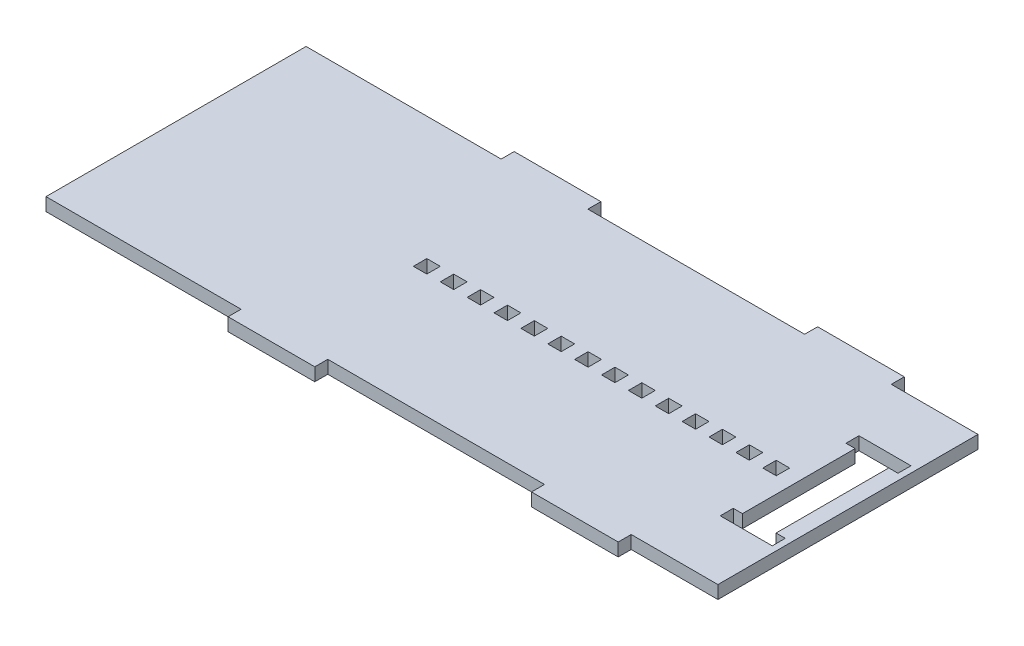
ISO-10303-21;
HEADER;
FILE_DESCRIPTION(('STEP AP214'),'2;1');
FILE_NAME('part.step','',(''),(''),'','','');
FILE_SCHEMA(('AUTOMOTIVE_DESIGN { 1 0 10303 214 1 1 1 1 }'));
ENDSEC;
DATA;
#1=APPLICATION_CONTEXT('core data for automotive mechanical design processes');
#2=APPLICATION_PROTOCOL_DEFINITION('international standard','automotive_design',2000,#1);
#3=PRODUCT_CONTEXT('',#1,'mechanical');
#4=PRODUCT('Part','Part','',(#3));
#5=PRODUCT_RELATED_PRODUCT_CATEGORY('part','',(#4));
#6=PRODUCT_DEFINITION_FORMATION('','',#4);
#7=PRODUCT_DEFINITION_CONTEXT('part definition',#1,'design');
#8=PRODUCT_DEFINITION('design','',#6,#7);
#9=PRODUCT_DEFINITION_SHAPE('','',#8);
#10=(LENGTH_UNIT() NAMED_UNIT(*) SI_UNIT(.MILLI.,.METRE.));
#11=(NAMED_UNIT(*) PLANE_ANGLE_UNIT() SI_UNIT($,.RADIAN.));
#12=(NAMED_UNIT(*) SI_UNIT($,.STERADIAN.) SOLID_ANGLE_UNIT());
#13=UNCERTAINTY_MEASURE_WITH_UNIT(LENGTH_MEASURE(1.E-05),#10,'distance_accuracy_value','');
#14=(GEOMETRIC_REPRESENTATION_CONTEXT(3) GLOBAL_UNCERTAINTY_ASSIGNED_CONTEXT((#13)) GLOBAL_UNIT_ASSIGNED_CONTEXT((#10,
#11,#12)) REPRESENTATION_CONTEXT('',''));
#15=CARTESIAN_POINT('',(0.,0.,0.));
#16=DIRECTION('',(0.,0.,1.));
#17=DIRECTION('',(1.,0.,0.));
#18=AXIS2_PLACEMENT_3D('',#15,#16,#17);
#19=CARTESIAN_POINT('',(65.,3.,30.));
#20=DIRECTION('',(0.,1.,0.));
#21=DIRECTION('',(0.,0.,1.));
#22=AXIS2_PLACEMENT_3D('',#19,#20,#21);
#23=PLANE('',#22);
#24=DIRECTION('',(1.,0.,0.));
#25=VECTOR('',#24,1.);
#26=CARTESIAN_POINT('',(65.,3.,-1.54999999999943));
#27=LINE('',#26,#25);
#28=CARTESIAN_POINT('',(-33.7,3.,-1.54999999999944));
#29=VERTEX_POINT('',#28);
#30=CARTESIAN_POINT('',(-30.6,3.,-1.54999999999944));
#31=VERTEX_POINT('',#30);
#32=EDGE_CURVE('E660',#29,#31,#27,.T.);
#33=ORIENTED_EDGE('',*,*,#32,.T.);
#34=DIRECTION('',(0.,0.,1.));
#35=VECTOR('',#34,1.);
#36=CARTESIAN_POINT('',(-30.6,3.,30.));
#37=LINE('',#36,#35);
#38=CARTESIAN_POINT('',(-30.6,3.,1.55000000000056));
#39=VERTEX_POINT('',#38);
#40=EDGE_CURVE('E663',#31,#39,#37,.T.);
#41=ORIENTED_EDGE('',*,*,#40,.T.);
#42=DIRECTION('',(-1.,0.,0.));
#43=VECTOR('',#42,1.);
#44=CARTESIAN_POINT('',(65.,3.,1.55000000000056));
#45=LINE('',#44,#43);
#46=CARTESIAN_POINT('',(-33.7,3.,1.55000000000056));
#47=VERTEX_POINT('',#46);
#48=EDGE_CURVE('E654',#39,#47,#45,.T.);
#49=ORIENTED_EDGE('',*,*,#48,.T.);
#50=DIRECTION('',(0.,0.,-1.));
#51=VECTOR('',#50,1.);
#52=CARTESIAN_POINT('',(-33.7,3.,30.));
#53=LINE('',#52,#51);
#54=EDGE_CURVE('E657',#47,#29,#53,.T.);
#55=ORIENTED_EDGE('',*,*,#54,.T.);
#56=EDGE_LOOP('',(#33,#41,#49,#55));
#57=FACE_BOUND('',#56,.T.);
#58=DIRECTION('',(1.,0.,0.));
#59=VECTOR('',#58,1.);
#60=CARTESIAN_POINT('',(65.,3.,-1.54999999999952));
#61=LINE('',#60,#59);
#62=CARTESIAN_POINT('',(-21.3,3.,-1.54999999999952));
#63=VERTEX_POINT('',#62);
#64=CARTESIAN_POINT('',(-18.2,3.,-1.54999999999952));
#65=VERTEX_POINT('',#64);
#66=EDGE_CURVE('E726',#63,#65,#61,.T.);
#67=ORIENTED_EDGE('',*,*,#66,.T.);
#68=DIRECTION('',(0.,0.,1.));
#69=VECTOR('',#68,1.);
#70=CARTESIAN_POINT('',(-18.2,3.,30.));
#71=LINE('',#70,#69);
#72=CARTESIAN_POINT('',(-18.2,3.,1.55000000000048));
#73=VERTEX_POINT('',#72);
#74=EDGE_CURVE('E729',#65,#73,#71,.T.);
#75=ORIENTED_EDGE('',*,*,#74,.T.);
#76=DIRECTION('',(-1.,0.,0.));
#77=VECTOR('',#76,1.);
#78=CARTESIAN_POINT('',(65.,3.,1.55000000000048));
#79=LINE('',#78,#77);
#80=CARTESIAN_POINT('',(-21.3,3.,1.55000000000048));
#81=VERTEX_POINT('',#80);
#82=EDGE_CURVE('E720',#73,#81,#79,.T.);
#83=ORIENTED_EDGE('',*,*,#82,.T.);
#84=DIRECTION('',(0.,0.,-1.));
#85=VECTOR('',#84,1.);
#86=CARTESIAN_POINT('',(-21.3,3.,30.));
#87=LINE('',#86,#85);
#88=EDGE_CURVE('E723',#81,#63,#87,.T.);
#89=ORIENTED_EDGE('',*,*,#88,.T.);
#90=EDGE_LOOP('',(#67,#75,#83,#89));
#91=FACE_BOUND('',#90,.T.);
#92=DIRECTION('',(1.,0.,0.));
#93=VECTOR('',#92,1.);
#94=CARTESIAN_POINT('',(65.,3.,-1.54999999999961));
#95=LINE('',#94,#93);
#96=CARTESIAN_POINT('',(-8.89999999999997,3.,-1.54999999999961));
#97=VERTEX_POINT('',#96);
#98=CARTESIAN_POINT('',(-5.79999999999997,3.,-1.54999999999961));
#99=VERTEX_POINT('',#98);
#100=EDGE_CURVE('E792',#97,#99,#95,.T.);
#101=ORIENTED_EDGE('',*,*,#100,.T.);
#102=DIRECTION('',(0.,0.,1.));
#103=VECTOR('',#102,1.);
#104=CARTESIAN_POINT('',(-5.79999999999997,3.,30.));
#105=LINE('',#104,#103);
#106=CARTESIAN_POINT('',(-5.79999999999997,3.,1.55000000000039));
#107=VERTEX_POINT('',#106);
#108=EDGE_CURVE('E795',#99,#107,#105,.T.);
#109=ORIENTED_EDGE('',*,*,#108,.T.);
#110=DIRECTION('',(-1.,0.,0.));
#111=VECTOR('',#110,1.);
#112=CARTESIAN_POINT('',(65.,3.,1.55000000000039));
#113=LINE('',#112,#111);
#114=CARTESIAN_POINT('',(-8.89999999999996,3.,1.55000000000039));
#115=VERTEX_POINT('',#114);
#116=EDGE_CURVE('E786',#107,#115,#113,.T.);
#117=ORIENTED_EDGE('',*,*,#116,.T.);
#118=DIRECTION('',(0.,0.,-1.));
#119=VECTOR('',#118,1.);
#120=CARTESIAN_POINT('',(-8.89999999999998,3.,30.));
#121=LINE('',#120,#119);
#122=EDGE_CURVE('E789',#115,#97,#121,.T.);
#123=ORIENTED_EDGE('',*,*,#122,.T.);
#124=EDGE_LOOP('',(#101,#109,#117,#123));
#125=FACE_BOUND('',#124,.T.);
#126=DIRECTION('',(1.,0.,0.));
#127=VECTOR('',#126,1.);
#128=CARTESIAN_POINT('',(65.,3.,-1.5499999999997));
#129=LINE('',#128,#127);
#130=CARTESIAN_POINT('',(3.50000000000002,3.,-1.5499999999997));
#131=VERTEX_POINT('',#130);
#132=CARTESIAN_POINT('',(6.60000000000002,3.,-1.5499999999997));
#133=VERTEX_POINT('',#132);
#134=EDGE_CURVE('E858',#131,#133,#129,.T.);
#135=ORIENTED_EDGE('',*,*,#134,.T.);
#136=DIRECTION('',(0.,0.,1.));
#137=VECTOR('',#136,1.);
#138=CARTESIAN_POINT('',(6.60000000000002,3.,30.));
#139=LINE('',#138,#137);
#140=CARTESIAN_POINT('',(6.60000000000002,3.,1.5500000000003));
#141=VERTEX_POINT('',#140);
#142=EDGE_CURVE('E861',#133,#141,#139,.T.);
#143=ORIENTED_EDGE('',*,*,#142,.T.);
#144=DIRECTION('',(-1.,0.,0.));
#145=VECTOR('',#144,1.);
#146=CARTESIAN_POINT('',(65.,3.,1.5500000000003));
#147=LINE('',#146,#145);
#148=CARTESIAN_POINT('',(3.50000000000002,3.,1.5500000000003));
#149=VERTEX_POINT('',#148);
#150=EDGE_CURVE('E852',#141,#149,#147,.T.);
#151=ORIENTED_EDGE('',*,*,#150,.T.);
#152=DIRECTION('',(0.,0.,-1.));
#153=VECTOR('',#152,1.);
#154=CARTESIAN_POINT('',(3.50000000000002,3.,30.));
#155=LINE('',#154,#153);
#156=EDGE_CURVE('E855',#149,#131,#155,.T.);
#157=ORIENTED_EDGE('',*,*,#156,.T.);
#158=EDGE_LOOP('',(#135,#143,#151,#157));
#159=FACE_BOUND('',#158,.T.);
#160=DIRECTION('',(1.,0.,0.));
#161=VECTOR('',#160,1.);
#162=CARTESIAN_POINT('',(65.,3.,-1.54999999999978));
#163=LINE('',#162,#161);
#164=CARTESIAN_POINT('',(15.9,3.,-1.54999999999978));
#165=VERTEX_POINT('',#164);
#166=CARTESIAN_POINT('',(19.,3.,-1.54999999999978));
#167=VERTEX_POINT('',#166);
#168=EDGE_CURVE('E924',#165,#167,#163,.T.);
#169=ORIENTED_EDGE('',*,*,#168,.T.);
#170=DIRECTION('',(0.,0.,1.));
#171=VECTOR('',#170,1.);
#172=CARTESIAN_POINT('',(19.,3.,30.));
#173=LINE('',#172,#171);
#174=CARTESIAN_POINT('',(19.,3.,1.55000000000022));
#175=VERTEX_POINT('',#174);
#176=EDGE_CURVE('E927',#167,#175,#173,.T.);
#177=ORIENTED_EDGE('',*,*,#176,.T.);
#178=DIRECTION('',(-1.,0.,0.));
#179=VECTOR('',#178,1.);
#180=CARTESIAN_POINT('',(65.,3.,1.55000000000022));
#181=LINE('',#180,#179);
#182=CARTESIAN_POINT('',(15.9,3.,1.55000000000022));
#183=VERTEX_POINT('',#182);
#184=EDGE_CURVE('E918',#175,#183,#181,.T.);
#185=ORIENTED_EDGE('',*,*,#184,.T.);
#186=DIRECTION('',(0.,0.,-1.));
#187=VECTOR('',#186,1.);
#188=CARTESIAN_POINT('',(15.9,3.,30.));
#189=LINE('',#188,#187);
#190=EDGE_CURVE('E921',#183,#165,#189,.T.);
#191=ORIENTED_EDGE('',*,*,#190,.T.);
#192=EDGE_LOOP('',(#169,#177,#185,#191));
#193=FACE_BOUND('',#192,.T.);
#194=DIRECTION('',(1.,0.,0.));
#195=VECTOR('',#194,1.);
#196=CARTESIAN_POINT('',(65.,3.,-1.54999999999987));
#197=LINE('',#196,#195);
#198=CARTESIAN_POINT('',(28.3,3.,-1.54999999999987));
#199=VERTEX_POINT('',#198);
#200=CARTESIAN_POINT('',(31.4,3.,-1.54999999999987));
#201=VERTEX_POINT('',#200);
#202=EDGE_CURVE('E990',#199,#201,#197,.T.);
#203=ORIENTED_EDGE('',*,*,#202,.T.);
#204=DIRECTION('',(0.,0.,1.));
#205=VECTOR('',#204,1.);
#206=CARTESIAN_POINT('',(31.4,3.,30.));
#207=LINE('',#206,#205);
#208=CARTESIAN_POINT('',(31.4,3.,1.55000000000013));
#209=VERTEX_POINT('',#208);
#210=EDGE_CURVE('E993',#201,#209,#207,.T.);
#211=ORIENTED_EDGE('',*,*,#210,.T.);
#212=DIRECTION('',(-1.,0.,0.));
#213=VECTOR('',#212,1.);
#214=CARTESIAN_POINT('',(65.,3.,1.55000000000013));
#215=LINE('',#214,#213);
#216=CARTESIAN_POINT('',(28.3,3.,1.55000000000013));
#217=VERTEX_POINT('',#216);
#218=EDGE_CURVE('E984',#209,#217,#215,.T.);
#219=ORIENTED_EDGE('',*,*,#218,.T.);
#220=DIRECTION('',(0.,0.,-1.));
#221=VECTOR('',#220,1.);
#222=CARTESIAN_POINT('',(28.3,3.,30.));
#223=LINE('',#222,#221);
#224=EDGE_CURVE('E987',#217,#199,#223,.T.);
#225=ORIENTED_EDGE('',*,*,#224,.T.);
#226=EDGE_LOOP('',(#203,#211,#219,#225));
#227=FACE_BOUND('',#226,.T.);
#228=DIRECTION('',(1.,0.,0.));
#229=VECTOR('',#228,1.);
#230=CARTESIAN_POINT('',(65.,3.,-1.54999999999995));
#231=LINE('',#230,#229);
#232=CARTESIAN_POINT('',(40.7,3.,-1.54999999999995));
#233=VERTEX_POINT('',#232);
#234=CARTESIAN_POINT('',(43.8,3.,-1.54999999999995));
#235=VERTEX_POINT('',#234);
#236=EDGE_CURVE('E1056',#233,#235,#231,.T.);
#237=ORIENTED_EDGE('',*,*,#236,.T.);
#238=DIRECTION('',(0.,0.,1.));
#239=VECTOR('',#238,1.);
#240=CARTESIAN_POINT('',(43.8,3.,30.));
#241=LINE('',#240,#239);
#242=CARTESIAN_POINT('',(43.8,3.,1.55000000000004));
#243=VERTEX_POINT('',#242);
#244=EDGE_CURVE('E1059',#235,#243,#241,.T.);
#245=ORIENTED_EDGE('',*,*,#244,.T.);
#246=DIRECTION('',(-1.,0.,0.));
#247=VECTOR('',#246,1.);
#248=CARTESIAN_POINT('',(65.,3.,1.55000000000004));
#249=LINE('',#248,#247);
#250=CARTESIAN_POINT('',(40.7,3.,1.55000000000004));
#251=VERTEX_POINT('',#250);
#252=EDGE_CURVE('E1050',#243,#251,#249,.T.);
#253=ORIENTED_EDGE('',*,*,#252,.T.);
#254=DIRECTION('',(0.,0.,-1.));
#255=VECTOR('',#254,1.);
#256=CARTESIAN_POINT('',(40.7,3.,30.));
#257=LINE('',#256,#255);
#258=EDGE_CURVE('E1053',#251,#233,#257,.T.);
#259=ORIENTED_EDGE('',*,*,#258,.T.);
#260=EDGE_LOOP('',(#237,#245,#253,#259));
#261=FACE_BOUND('',#260,.T.);
#262=DIRECTION('',(0.,0.,-1.));
#263=VECTOR('',#262,1.);
#264=CARTESIAN_POINT('',(65.,3.,-30.));
#265=LINE('',#264,#263);
#266=CARTESIAN_POINT('',(65.,3.,30.));
#267=VERTEX_POINT('',#266);
#268=CARTESIAN_POINT('',(65.,3.,-30.));
#269=VERTEX_POINT('',#268);
#270=EDGE_CURVE('E1184',#267,#269,#265,.T.);
#271=ORIENTED_EDGE('',*,*,#270,.T.);
#272=DIRECTION('',(-1.,0.,0.));
#273=VECTOR('',#272,1.);
#274=CARTESIAN_POINT('',(-65.,3.,-30.));
#275=LINE('',#274,#273);
#276=CARTESIAN_POINT('',(45.,3.,-30.));
#277=VERTEX_POINT('',#276);
#278=EDGE_CURVE('E1200',#269,#277,#275,.T.);
#279=ORIENTED_EDGE('',*,*,#278,.T.);
#280=DIRECTION('',(0.,0.,-1.));
#281=VECTOR('',#280,1.);
#282=CARTESIAN_POINT('',(45.,3.,-33.));
#283=LINE('',#282,#281);
#284=CARTESIAN_POINT('',(45.,3.,-33.));
#285=VERTEX_POINT('',#284);
#286=EDGE_CURVE('E1259',#277,#285,#283,.T.);
#287=ORIENTED_EDGE('',*,*,#286,.T.);
#288=DIRECTION('',(-1.,0.,0.));
#289=VECTOR('',#288,1.);
#290=CARTESIAN_POINT('',(25.,3.,-33.));
#291=LINE('',#290,#289);
#292=CARTESIAN_POINT('',(25.,3.,-33.));
#293=VERTEX_POINT('',#292);
#294=EDGE_CURVE('E1272',#285,#293,#291,.T.);
#295=ORIENTED_EDGE('',*,*,#294,.T.);
#296=DIRECTION('',(0.,0.,1.));
#297=VECTOR('',#296,1.);
#298=CARTESIAN_POINT('',(25.,3.,-33.));
#299=LINE('',#298,#297);
#300=CARTESIAN_POINT('',(25.,3.,-30.));
#301=VERTEX_POINT('',#300);
#302=EDGE_CURVE('E1268',#293,#301,#299,.T.);
#303=ORIENTED_EDGE('',*,*,#302,.T.);
#304=CARTESIAN_POINT('',(-25.,3.,-30.));
#305=VERTEX_POINT('',#304);
#306=EDGE_CURVE('E1188',#301,#305,#275,.T.);
#307=ORIENTED_EDGE('',*,*,#306,.T.);
#308=DIRECTION('',(0.,0.,-1.));
#309=VECTOR('',#308,1.);
#310=CARTESIAN_POINT('',(-25.,3.,-33.));
#311=LINE('',#310,#309);
#312=CARTESIAN_POINT('',(-25.,3.,-33.));
#313=VERTEX_POINT('',#312);
#314=EDGE_CURVE('E1325',#305,#313,#311,.T.);
#315=ORIENTED_EDGE('',*,*,#314,.T.);
#316=DIRECTION('',(-1.,0.,0.));
#317=VECTOR('',#316,1.);
#318=CARTESIAN_POINT('',(-45.,3.,-33.));
#319=LINE('',#318,#317);
#320=CARTESIAN_POINT('',(-45.,3.,-33.));
#321=VERTEX_POINT('',#320);
#322=EDGE_CURVE('E1329',#313,#321,#319,.T.);
#323=ORIENTED_EDGE('',*,*,#322,.T.);
#324=DIRECTION('',(0.,0.,1.));
#325=VECTOR('',#324,1.);
#326=CARTESIAN_POINT('',(-45.,3.,-33.));
#327=LINE('',#326,#325);
#328=CARTESIAN_POINT('',(-45.,3.,-30.));
#329=VERTEX_POINT('',#328);
#330=EDGE_CURVE('E1332',#321,#329,#327,.T.);
#331=ORIENTED_EDGE('',*,*,#330,.T.);
#332=CARTESIAN_POINT('',(-90.,3.,-30.));
#333=VERTEX_POINT('',#332);
#334=EDGE_CURVE('E1185',#329,#333,#275,.T.);
#335=ORIENTED_EDGE('',*,*,#334,.T.);
#336=DIRECTION('',(0.,0.,1.));
#337=VECTOR('',#336,1.);
#338=CARTESIAN_POINT('',(-90.,3.,-30.));
#339=LINE('',#338,#337);
#340=CARTESIAN_POINT('',(-90.,3.,30.));
#341=VERTEX_POINT('',#340);
#342=EDGE_CURVE('E1096',#333,#341,#339,.T.);
#343=ORIENTED_EDGE('',*,*,#342,.T.);
#344=DIRECTION('',(1.,0.,0.));
#345=VECTOR('',#344,1.);
#346=CARTESIAN_POINT('',(-65.,3.,30.));
#347=LINE('',#346,#345);
#348=CARTESIAN_POINT('',(-45.,3.,30.));
#349=VERTEX_POINT('',#348);
#350=EDGE_CURVE('E1212',#341,#349,#347,.T.);
#351=ORIENTED_EDGE('',*,*,#350,.T.);
#352=DIRECTION('',(0.,0.,1.));
#353=VECTOR('',#352,1.);
#354=CARTESIAN_POINT('',(-45.,3.,33.));
#355=LINE('',#354,#353);
#356=CARTESIAN_POINT('',(-45.,3.,33.));
#357=VERTEX_POINT('',#356);
#358=EDGE_CURVE('E1139',#349,#357,#355,.T.);
#359=ORIENTED_EDGE('',*,*,#358,.T.);
#360=DIRECTION('',(1.,0.,0.));
#361=VECTOR('',#360,1.);
#362=CARTESIAN_POINT('',(-45.,3.,33.));
#363=LINE('',#362,#361);
#364=CARTESIAN_POINT('',(-25.,3.,33.));
#365=VERTEX_POINT('',#364);
#366=EDGE_CURVE('E1136',#357,#365,#363,.T.);
#367=ORIENTED_EDGE('',*,*,#366,.T.);
#368=DIRECTION('',(0.,0.,-1.));
#369=VECTOR('',#368,1.);
#370=CARTESIAN_POINT('',(-25.,3.,33.));
#371=LINE('',#370,#369);
#372=CARTESIAN_POINT('',(-25.,3.,30.));
#373=VERTEX_POINT('',#372);
#374=EDGE_CURVE('E1138',#365,#373,#371,.T.);
#375=ORIENTED_EDGE('',*,*,#374,.T.);
#376=CARTESIAN_POINT('',(25.,3.,30.));
#377=VERTEX_POINT('',#376);
#378=EDGE_CURVE('E1218',#373,#377,#347,.T.);
#379=ORIENTED_EDGE('',*,*,#378,.T.);
#380=DIRECTION('',(0.,0.,1.));
#381=VECTOR('',#380,1.);
#382=CARTESIAN_POINT('',(25.,3.,33.));
#383=LINE('',#382,#381);
#384=CARTESIAN_POINT('',(25.,3.,33.));
#385=VERTEX_POINT('',#384);
#386=EDGE_CURVE('E1108',#377,#385,#383,.T.);
#387=ORIENTED_EDGE('',*,*,#386,.T.);
#388=DIRECTION('',(1.,0.,0.));
#389=VECTOR('',#388,1.);
#390=CARTESIAN_POINT('',(25.,3.,33.));
#391=LINE('',#390,#389);
#392=CARTESIAN_POINT('',(45.,3.,33.));
#393=VERTEX_POINT('',#392);
#394=EDGE_CURVE('E1111',#385,#393,#391,.T.);
#395=ORIENTED_EDGE('',*,*,#394,.T.);
#396=DIRECTION('',(0.,0.,-1.));
#397=VECTOR('',#396,1.);
#398=CARTESIAN_POINT('',(45.,3.,33.));
#399=LINE('',#398,#397);
#400=CARTESIAN_POINT('',(45.,3.,30.));
#401=VERTEX_POINT('',#400);
#402=EDGE_CURVE('E1114',#393,#401,#399,.T.);
#403=ORIENTED_EDGE('',*,*,#402,.T.);
#404=EDGE_CURVE('E1167',#401,#267,#347,.T.);
#405=ORIENTED_EDGE('',*,*,#404,.T.);
#406=EDGE_LOOP('',(#271,#279,#287,#295,#303,#307,#315,#323,#331,#335,#343,#351,#359,#367,#375,
#379,#387,#395,#403,#405));
#407=FACE_BOUND('',#406,.T.);
#408=DIRECTION('',(1.,0.,0.));
#409=VECTOR('',#408,1.);
#410=CARTESIAN_POINT('',(65.,3.,-1.55));
#411=LINE('',#410,#409);
#412=CARTESIAN_POINT('',(46.9,3.,-1.55));
#413=VERTEX_POINT('',#412);
#414=CARTESIAN_POINT('',(50.,3.,-1.55));
#415=VERTEX_POINT('',#414);
#416=EDGE_CURVE('E1089',#413,#415,#411,.T.);
#417=ORIENTED_EDGE('',*,*,#416,.T.);
#418=DIRECTION('',(0.,0.,1.));
#419=VECTOR('',#418,1.);
#420=CARTESIAN_POINT('',(50.,3.,30.));
#421=LINE('',#420,#419);
#422=CARTESIAN_POINT('',(50.,3.,1.55));
#423=VERTEX_POINT('',#422);
#424=EDGE_CURVE('E1092',#415,#423,#421,.T.);
#425=ORIENTED_EDGE('',*,*,#424,.T.);
#426=DIRECTION('',(-1.,0.,0.));
#427=VECTOR('',#426,1.);
#428=CARTESIAN_POINT('',(65.,3.,1.55));
#429=LINE('',#428,#427);
#430=CARTESIAN_POINT('',(46.9,3.,1.55));
#431=VERTEX_POINT('',#430);
#432=EDGE_CURVE('E1083',#423,#431,#429,.T.);
#433=ORIENTED_EDGE('',*,*,#432,.T.);
#434=DIRECTION('',(0.,0.,-1.));
#435=VECTOR('',#434,1.);
#436=CARTESIAN_POINT('',(46.9,3.,30.));
#437=LINE('',#436,#435);
#438=EDGE_CURVE('E1086',#431,#413,#437,.T.);
#439=ORIENTED_EDGE('',*,*,#438,.T.);
#440=EDGE_LOOP('',(#417,#425,#433,#439));
#441=FACE_BOUND('',#440,.T.);
#442=DIRECTION('',(1.,0.,0.));
#443=VECTOR('',#442,1.);
#444=CARTESIAN_POINT('',(65.,3.,-1.54999999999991));
#445=LINE('',#444,#443);
#446=CARTESIAN_POINT('',(34.5,3.,-1.54999999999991));
#447=VERTEX_POINT('',#446);
#448=CARTESIAN_POINT('',(37.6,3.,-1.54999999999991));
#449=VERTEX_POINT('',#448);
#450=EDGE_CURVE('E1023',#447,#449,#445,.T.);
#451=ORIENTED_EDGE('',*,*,#450,.T.);
#452=DIRECTION('',(0.,0.,1.));
#453=VECTOR('',#452,1.);
#454=CARTESIAN_POINT('',(37.6,3.,30.));
#455=LINE('',#454,#453);
#456=CARTESIAN_POINT('',(37.6,3.,1.55000000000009));
#457=VERTEX_POINT('',#456);
#458=EDGE_CURVE('E1026',#449,#457,#455,.T.);
#459=ORIENTED_EDGE('',*,*,#458,.T.);
#460=DIRECTION('',(-1.,0.,0.));
#461=VECTOR('',#460,1.);
#462=CARTESIAN_POINT('',(65.,3.,1.55000000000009));
#463=LINE('',#462,#461);
#464=CARTESIAN_POINT('',(34.5,3.,1.55000000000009));
#465=VERTEX_POINT('',#464);
#466=EDGE_CURVE('E1017',#457,#465,#463,.T.);
#467=ORIENTED_EDGE('',*,*,#466,.T.);
#468=DIRECTION('',(0.,0.,-1.));
#469=VECTOR('',#468,1.);
#470=CARTESIAN_POINT('',(34.5,3.,30.));
#471=LINE('',#470,#469);
#472=EDGE_CURVE('E1020',#465,#447,#471,.T.);
#473=ORIENTED_EDGE('',*,*,#472,.T.);
#474=EDGE_LOOP('',(#451,#459,#467,#473));
#475=FACE_BOUND('',#474,.T.);
#476=DIRECTION('',(1.,0.,0.));
#477=VECTOR('',#476,1.);
#478=CARTESIAN_POINT('',(65.,3.,-1.54999999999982));
#479=LINE('',#478,#477);
#480=CARTESIAN_POINT('',(22.1,3.,-1.54999999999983));
#481=VERTEX_POINT('',#480);
#482=CARTESIAN_POINT('',(25.2,3.,-1.54999999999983));
#483=VERTEX_POINT('',#482);
#484=EDGE_CURVE('E957',#481,#483,#479,.T.);
#485=ORIENTED_EDGE('',*,*,#484,.T.);
#486=DIRECTION('',(0.,0.,1.));
#487=VECTOR('',#486,1.);
#488=CARTESIAN_POINT('',(25.2,3.,30.));
#489=LINE('',#488,#487);
#490=CARTESIAN_POINT('',(25.2,3.,1.55000000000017));
#491=VERTEX_POINT('',#490);
#492=EDGE_CURVE('E960',#483,#491,#489,.T.);
#493=ORIENTED_EDGE('',*,*,#492,.T.);
#494=DIRECTION('',(-1.,0.,0.));
#495=VECTOR('',#494,1.);
#496=CARTESIAN_POINT('',(65.,3.,1.55000000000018));
#497=LINE('',#496,#495);
#498=CARTESIAN_POINT('',(22.1,3.,1.55000000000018));
#499=VERTEX_POINT('',#498);
#500=EDGE_CURVE('E951',#491,#499,#497,.T.);
#501=ORIENTED_EDGE('',*,*,#500,.T.);
#502=DIRECTION('',(0.,0.,-1.));
#503=VECTOR('',#502,1.);
#504=CARTESIAN_POINT('',(22.1,3.,30.));
#505=LINE('',#504,#503);
#506=EDGE_CURVE('E954',#499,#481,#505,.T.);
#507=ORIENTED_EDGE('',*,*,#506,.T.);
#508=EDGE_LOOP('',(#485,#493,#501,#507));
#509=FACE_BOUND('',#508,.T.);
#510=DIRECTION('',(1.,0.,0.));
#511=VECTOR('',#510,1.);
#512=CARTESIAN_POINT('',(65.,3.,-1.54999999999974));
#513=LINE('',#512,#511);
#514=CARTESIAN_POINT('',(9.70000000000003,3.,-1.54999999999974));
#515=VERTEX_POINT('',#514);
#516=CARTESIAN_POINT('',(12.8,3.,-1.54999999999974));
#517=VERTEX_POINT('',#516);
#518=EDGE_CURVE('E891',#515,#517,#513,.T.);
#519=ORIENTED_EDGE('',*,*,#518,.T.);
#520=DIRECTION('',(0.,0.,1.));
#521=VECTOR('',#520,1.);
#522=CARTESIAN_POINT('',(12.8,3.,30.));
#523=LINE('',#522,#521);
#524=CARTESIAN_POINT('',(12.8,3.,1.55000000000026));
#525=VERTEX_POINT('',#524);
#526=EDGE_CURVE('E894',#517,#525,#523,.T.);
#527=ORIENTED_EDGE('',*,*,#526,.T.);
#528=DIRECTION('',(-1.,0.,0.));
#529=VECTOR('',#528,1.);
#530=CARTESIAN_POINT('',(65.,3.,1.55000000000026));
#531=LINE('',#530,#529);
#532=CARTESIAN_POINT('',(9.70000000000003,3.,1.55000000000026));
#533=VERTEX_POINT('',#532);
#534=EDGE_CURVE('E885',#525,#533,#531,.T.);
#535=ORIENTED_EDGE('',*,*,#534,.T.);
#536=DIRECTION('',(0.,0.,-1.));
#537=VECTOR('',#536,1.);
#538=CARTESIAN_POINT('',(9.70000000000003,3.,30.));
#539=LINE('',#538,#537);
#540=EDGE_CURVE('E888',#533,#515,#539,.T.);
#541=ORIENTED_EDGE('',*,*,#540,.T.);
#542=EDGE_LOOP('',(#519,#527,#535,#541));
#543=FACE_BOUND('',#542,.T.);
#544=DIRECTION('',(1.,0.,0.));
#545=VECTOR('',#544,1.);
#546=CARTESIAN_POINT('',(65.,3.,-1.54999999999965));
#547=LINE('',#546,#545);
#548=CARTESIAN_POINT('',(-2.69999999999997,3.,-1.54999999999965));
#549=VERTEX_POINT('',#548);
#550=CARTESIAN_POINT('',(0.400000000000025,3.,-1.54999999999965));
#551=VERTEX_POINT('',#550);
#552=EDGE_CURVE('E825',#549,#551,#547,.T.);
#553=ORIENTED_EDGE('',*,*,#552,.T.);
#554=DIRECTION('',(0.,0.,1.));
#555=VECTOR('',#554,1.);
#556=CARTESIAN_POINT('',(0.400000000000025,3.,30.));
#557=LINE('',#556,#555);
#558=CARTESIAN_POINT('',(0.400000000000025,3.,1.55000000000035));
#559=VERTEX_POINT('',#558);
#560=EDGE_CURVE('E828',#551,#559,#557,.T.);
#561=ORIENTED_EDGE('',*,*,#560,.T.);
#562=DIRECTION('',(-1.,0.,0.));
#563=VECTOR('',#562,1.);
#564=CARTESIAN_POINT('',(65.,3.,1.55000000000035));
#565=LINE('',#564,#563);
#566=CARTESIAN_POINT('',(-2.69999999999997,3.,1.55000000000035));
#567=VERTEX_POINT('',#566);
#568=EDGE_CURVE('E819',#559,#567,#565,.T.);
#569=ORIENTED_EDGE('',*,*,#568,.T.);
#570=DIRECTION('',(0.,0.,-1.));
#571=VECTOR('',#570,1.);
#572=CARTESIAN_POINT('',(-2.69999999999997,3.,30.));
#573=LINE('',#572,#571);
#574=EDGE_CURVE('E822',#567,#549,#573,.T.);
#575=ORIENTED_EDGE('',*,*,#574,.T.);
#576=EDGE_LOOP('',(#553,#561,#569,#575));
#577=FACE_BOUND('',#576,.T.);
#578=DIRECTION('',(1.,0.,0.));
#579=VECTOR('',#578,1.);
#580=CARTESIAN_POINT('',(65.,3.,-1.54999999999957));
#581=LINE('',#580,#579);
#582=CARTESIAN_POINT('',(-15.1,3.,-1.54999999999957));
#583=VERTEX_POINT('',#582);
#584=CARTESIAN_POINT('',(-12.,3.,-1.54999999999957));
#585=VERTEX_POINT('',#584);
#586=EDGE_CURVE('E759',#583,#585,#581,.T.);
#587=ORIENTED_EDGE('',*,*,#586,.T.);
#588=DIRECTION('',(0.,0.,1.));
#589=VECTOR('',#588,1.);
#590=CARTESIAN_POINT('',(-12.,3.,30.));
#591=LINE('',#590,#589);
#592=CARTESIAN_POINT('',(-12.,3.,1.55000000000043));
#593=VERTEX_POINT('',#592);
#594=EDGE_CURVE('E762',#585,#593,#591,.T.);
#595=ORIENTED_EDGE('',*,*,#594,.T.);
#596=DIRECTION('',(-1.,0.,0.));
#597=VECTOR('',#596,1.);
#598=CARTESIAN_POINT('',(65.,3.,1.55000000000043));
#599=LINE('',#598,#597);
#600=CARTESIAN_POINT('',(-15.1,3.,1.55000000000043));
#601=VERTEX_POINT('',#600);
#602=EDGE_CURVE('E753',#593,#601,#599,.T.);
#603=ORIENTED_EDGE('',*,*,#602,.T.);
#604=DIRECTION('',(0.,0.,-1.));
#605=VECTOR('',#604,1.);
#606=CARTESIAN_POINT('',(-15.1,3.,30.));
#607=LINE('',#606,#605);
#608=EDGE_CURVE('E756',#601,#583,#607,.T.);
#609=ORIENTED_EDGE('',*,*,#608,.T.);
#610=EDGE_LOOP('',(#587,#595,#603,#609));
#611=FACE_BOUND('',#610,.T.);
#612=DIRECTION('',(1.,0.,0.));
#613=VECTOR('',#612,1.);
#614=CARTESIAN_POINT('',(65.,3.,-1.54999999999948));
#615=LINE('',#614,#613);
#616=CARTESIAN_POINT('',(-27.5,3.,-1.54999999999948));
#617=VERTEX_POINT('',#616);
#618=CARTESIAN_POINT('',(-24.4,3.,-1.54999999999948));
#619=VERTEX_POINT('',#618);
#620=EDGE_CURVE('E693',#617,#619,#615,.T.);
#621=ORIENTED_EDGE('',*,*,#620,.T.);
#622=DIRECTION('',(0.,0.,1.));
#623=VECTOR('',#622,1.);
#624=CARTESIAN_POINT('',(-24.4,3.,30.));
#625=LINE('',#624,#623);
#626=CARTESIAN_POINT('',(-24.4,3.,1.55000000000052));
#627=VERTEX_POINT('',#626);
#628=EDGE_CURVE('E696',#619,#627,#625,.T.);
#629=ORIENTED_EDGE('',*,*,#628,.T.);
#630=DIRECTION('',(-1.,0.,0.));
#631=VECTOR('',#630,1.);
#632=CARTESIAN_POINT('',(65.,3.,1.55000000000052));
#633=LINE('',#632,#631);
#634=CARTESIAN_POINT('',(-27.5,3.,1.55000000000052));
#635=VERTEX_POINT('',#634);
#636=EDGE_CURVE('E687',#627,#635,#633,.T.);
#637=ORIENTED_EDGE('',*,*,#636,.T.);
#638=DIRECTION('',(0.,0.,-1.));
#639=VECTOR('',#638,1.);
#640=CARTESIAN_POINT('',(-27.5,3.,30.));
#641=LINE('',#640,#639);
#642=EDGE_CURVE('E690',#635,#617,#641,.T.);
#643=ORIENTED_EDGE('',*,*,#642,.T.);
#644=EDGE_LOOP('',(#621,#629,#637,#643));
#645=FACE_BOUND('',#644,.T.);
#646=DIRECTION('',(-1.,0.,0.));
#647=VECTOR('',#646,1.);
#648=CARTESIAN_POINT('',(65.,3.,-13.));
#649=LINE('',#648,#647);
#650=CARTESIAN_POINT('',(63.54,3.,-13.));
#651=VERTEX_POINT('',#650);
#652=CARTESIAN_POINT('',(61.413,3.,-13.));
#653=VERTEX_POINT('',#652);
#654=EDGE_CURVE('E628',#651,#653,#649,.T.);
#655=ORIENTED_EDGE('',*,*,#654,.T.);
#656=DIRECTION('',(0.,0.,1.));
#657=VECTOR('',#656,1.);
#658=CARTESIAN_POINT('',(61.413,3.,30.));
#659=LINE('',#658,#657);
#660=CARTESIAN_POINT('',(61.413,3.,13.));
#661=VERTEX_POINT('',#660);
#662=EDGE_CURVE('E578',#653,#661,#659,.T.);
#663=ORIENTED_EDGE('',*,*,#662,.T.);
#664=DIRECTION('',(1.,0.,0.));
#665=VECTOR('',#664,1.);
#666=CARTESIAN_POINT('',(65.,3.,13.));
#667=LINE('',#666,#665);
#668=CARTESIAN_POINT('',(63.54,3.,13.));
#669=VERTEX_POINT('',#668);
#670=EDGE_CURVE('E2255',#661,#669,#667,.T.);
#671=ORIENTED_EDGE('',*,*,#670,.T.);
#672=DIRECTION('',(0.,0.,1.));
#673=VECTOR('',#672,1.);
#674=CARTESIAN_POINT('',(63.54,3.,30.));
#675=LINE('',#674,#673);
#676=CARTESIAN_POINT('',(63.54,3.,16.));
#677=VERTEX_POINT('',#676);
#678=EDGE_CURVE('E2258',#669,#677,#675,.T.);
#679=ORIENTED_EDGE('',*,*,#678,.T.);
#680=DIRECTION('',(-1.,0.,0.));
#681=VECTOR('',#680,1.);
#682=CARTESIAN_POINT('',(65.,3.,16.));
#683=LINE('',#682,#681);
#684=CARTESIAN_POINT('',(51.54,3.,16.));
#685=VERTEX_POINT('',#684);
#686=EDGE_CURVE('E605',#677,#685,#683,.T.);
#687=ORIENTED_EDGE('',*,*,#686,.T.);
#688=DIRECTION('',(0.,0.,-1.));
#689=VECTOR('',#688,1.);
#690=CARTESIAN_POINT('',(51.5400000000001,3.,30.));
#691=LINE('',#690,#689);
#692=CARTESIAN_POINT('',(51.54,3.,13.));
#693=VERTEX_POINT('',#692);
#694=EDGE_CURVE('E2252',#685,#693,#691,.T.);
#695=ORIENTED_EDGE('',*,*,#694,.T.);
#696=CARTESIAN_POINT('',(53.667,3.,13.));
#697=VERTEX_POINT('',#696);
#698=EDGE_CURVE('E2256',#693,#697,#667,.T.);
#699=ORIENTED_EDGE('',*,*,#698,.T.);
#700=DIRECTION('',(0.,0.,-1.));
#701=VECTOR('',#700,1.);
#702=CARTESIAN_POINT('',(53.667,3.,30.));
#703=LINE('',#702,#701);
#704=CARTESIAN_POINT('',(53.667,3.,-13.));
#705=VERTEX_POINT('',#704);
#706=EDGE_CURVE('E48',#697,#705,#703,.T.);
#707=ORIENTED_EDGE('',*,*,#706,.T.);
#708=CARTESIAN_POINT('',(51.54,3.,-13.));
#709=VERTEX_POINT('',#708);
#710=EDGE_CURVE('E627',#705,#709,#649,.T.);
#711=ORIENTED_EDGE('',*,*,#710,.T.);
#712=DIRECTION('',(0.,0.,-1.));
#713=VECTOR('',#712,1.);
#714=CARTESIAN_POINT('',(51.54,3.,30.));
#715=LINE('',#714,#713);
#716=CARTESIAN_POINT('',(51.54,3.,-16.));
#717=VERTEX_POINT('',#716);
#718=EDGE_CURVE('E630',#709,#717,#715,.T.);
#719=ORIENTED_EDGE('',*,*,#718,.T.);
#720=DIRECTION('',(1.,0.,0.));
#721=VECTOR('',#720,1.);
#722=CARTESIAN_POINT('',(65.,3.,-16.));
#723=LINE('',#722,#721);
#724=CARTESIAN_POINT('',(63.54,3.,-16.));
#725=VERTEX_POINT('',#724);
#726=EDGE_CURVE('E621',#717,#725,#723,.T.);
#727=ORIENTED_EDGE('',*,*,#726,.T.);
#728=DIRECTION('',(0.,0.,1.));
#729=VECTOR('',#728,1.);
#730=CARTESIAN_POINT('',(63.54,3.,30.));
#731=LINE('',#730,#729);
#732=EDGE_CURVE('E624',#725,#651,#731,.T.);
#733=ORIENTED_EDGE('',*,*,#732,.T.);
#734=EDGE_LOOP('',(#655,#663,#671,#679,#687,#695,#699,#707,#711,#719,#727,#733));
#735=FACE_BOUND('',#734,.T.);
#736=ADVANCED_FACE('F33',(#57,#91,#125,#159,#193,#227,#261,#407,#441,#475,#509,#543,#577,#611,
#645,#735),#23,.T.);
#737=CARTESIAN_POINT('',(65.,0.,30.));
#738=DIRECTION('',(0.,1.,0.));
#739=DIRECTION('',(0.,0.,1.));
#740=AXIS2_PLACEMENT_3D('',#737,#738,#739);
#741=PLANE('',#740);
#742=DIRECTION('',(0.,0.,-1.));
#743=VECTOR('',#742,1.);
#744=CARTESIAN_POINT('',(-30.6,0.,-1.54999999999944));
#745=LINE('',#744,#743);
#746=CARTESIAN_POINT('',(-30.6,0.,1.55000000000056));
#747=VERTEX_POINT('',#746);
#748=CARTESIAN_POINT('',(-30.6,0.,-1.54999999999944));
#749=VERTEX_POINT('',#748);
#750=EDGE_CURVE('E633',#747,#749,#745,.T.);
#751=ORIENTED_EDGE('',*,*,#750,.T.);
#752=DIRECTION('',(-1.,0.,0.));
#753=VECTOR('',#752,1.);
#754=CARTESIAN_POINT('',(-33.7,0.,-1.54999999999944));
#755=LINE('',#754,#753);
#756=CARTESIAN_POINT('',(-33.7,0.,-1.54999999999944));
#757=VERTEX_POINT('',#756);
#758=EDGE_CURVE('E636',#749,#757,#755,.T.);
#759=ORIENTED_EDGE('',*,*,#758,.T.);
#760=DIRECTION('',(0.,0.,1.));
#761=VECTOR('',#760,1.);
#762=CARTESIAN_POINT('',(-33.7,0.,-1.54999999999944));
#763=LINE('',#762,#761);
#764=CARTESIAN_POINT('',(-33.7,0.,1.55000000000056));
#765=VERTEX_POINT('',#764);
#766=EDGE_CURVE('E639',#757,#765,#763,.T.);
#767=ORIENTED_EDGE('',*,*,#766,.T.);
#768=DIRECTION('',(1.,0.,0.));
#769=VECTOR('',#768,1.);
#770=CARTESIAN_POINT('',(-33.7,0.,1.55000000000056));
#771=LINE('',#770,#769);
#772=EDGE_CURVE('E642',#765,#747,#771,.T.);
#773=ORIENTED_EDGE('',*,*,#772,.T.);
#774=EDGE_LOOP('',(#751,#759,#767,#773));
#775=FACE_BOUND('',#774,.T.);
#776=DIRECTION('',(0.,0.,-1.));
#777=VECTOR('',#776,1.);
#778=CARTESIAN_POINT('',(-18.2,0.,-1.54999999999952));
#779=LINE('',#778,#777);
#780=CARTESIAN_POINT('',(-18.2,0.,1.55000000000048));
#781=VERTEX_POINT('',#780);
#782=CARTESIAN_POINT('',(-18.2,0.,-1.54999999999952));
#783=VERTEX_POINT('',#782);
#784=EDGE_CURVE('E699',#781,#783,#779,.T.);
#785=ORIENTED_EDGE('',*,*,#784,.T.);
#786=DIRECTION('',(-1.,0.,0.));
#787=VECTOR('',#786,1.);
#788=CARTESIAN_POINT('',(-21.3,0.,-1.54999999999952));
#789=LINE('',#788,#787);
#790=CARTESIAN_POINT('',(-21.3,0.,-1.54999999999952));
#791=VERTEX_POINT('',#790);
#792=EDGE_CURVE('E702',#783,#791,#789,.T.);
#793=ORIENTED_EDGE('',*,*,#792,.T.);
#794=DIRECTION('',(0.,0.,1.));
#795=VECTOR('',#794,1.);
#796=CARTESIAN_POINT('',(-21.3,0.,-1.54999999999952));
#797=LINE('',#796,#795);
#798=CARTESIAN_POINT('',(-21.3,0.,1.55000000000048));
#799=VERTEX_POINT('',#798);
#800=EDGE_CURVE('E705',#791,#799,#797,.T.);
#801=ORIENTED_EDGE('',*,*,#800,.T.);
#802=DIRECTION('',(1.,0.,0.));
#803=VECTOR('',#802,1.);
#804=CARTESIAN_POINT('',(-21.3,0.,1.55000000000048));
#805=LINE('',#804,#803);
#806=EDGE_CURVE('E708',#799,#781,#805,.T.);
#807=ORIENTED_EDGE('',*,*,#806,.T.);
#808=EDGE_LOOP('',(#785,#793,#801,#807));
#809=FACE_BOUND('',#808,.T.);
#810=DIRECTION('',(0.,0.,-1.));
#811=VECTOR('',#810,1.);
#812=CARTESIAN_POINT('',(-5.79999999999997,0.,-1.54999999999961));
#813=LINE('',#812,#811);
#814=CARTESIAN_POINT('',(-5.79999999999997,0.,1.55000000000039));
#815=VERTEX_POINT('',#814);
#816=CARTESIAN_POINT('',(-5.79999999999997,0.,-1.54999999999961));
#817=VERTEX_POINT('',#816);
#818=EDGE_CURVE('E765',#815,#817,#813,.T.);
#819=ORIENTED_EDGE('',*,*,#818,.T.);
#820=DIRECTION('',(-1.,0.,0.));
#821=VECTOR('',#820,1.);
#822=CARTESIAN_POINT('',(-8.89999999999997,0.,-1.54999999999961));
#823=LINE('',#822,#821);
#824=CARTESIAN_POINT('',(-8.89999999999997,0.,-1.54999999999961));
#825=VERTEX_POINT('',#824);
#826=EDGE_CURVE('E768',#817,#825,#823,.T.);
#827=ORIENTED_EDGE('',*,*,#826,.T.);
#828=DIRECTION('',(0.,0.,1.));
#829=VECTOR('',#828,1.);
#830=CARTESIAN_POINT('',(-8.89999999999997,0.,-1.54999999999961));
#831=LINE('',#830,#829);
#832=CARTESIAN_POINT('',(-8.89999999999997,0.,1.55000000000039));
#833=VERTEX_POINT('',#832);
#834=EDGE_CURVE('E771',#825,#833,#831,.T.);
#835=ORIENTED_EDGE('',*,*,#834,.T.);
#836=DIRECTION('',(1.,0.,0.));
#837=VECTOR('',#836,1.);
#838=CARTESIAN_POINT('',(-8.89999999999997,0.,1.55000000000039));
#839=LINE('',#838,#837);
#840=EDGE_CURVE('E774',#833,#815,#839,.T.);
#841=ORIENTED_EDGE('',*,*,#840,.T.);
#842=EDGE_LOOP('',(#819,#827,#835,#841));
#843=FACE_BOUND('',#842,.T.);
#844=DIRECTION('',(0.,0.,-1.));
#845=VECTOR('',#844,1.);
#846=CARTESIAN_POINT('',(6.60000000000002,0.,-1.5499999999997));
#847=LINE('',#846,#845);
#848=CARTESIAN_POINT('',(6.60000000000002,0.,1.5500000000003));
#849=VERTEX_POINT('',#848);
#850=CARTESIAN_POINT('',(6.60000000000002,0.,-1.5499999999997));
#851=VERTEX_POINT('',#850);
#852=EDGE_CURVE('E831',#849,#851,#847,.T.);
#853=ORIENTED_EDGE('',*,*,#852,.T.);
#854=DIRECTION('',(-1.,0.,0.));
#855=VECTOR('',#854,1.);
#856=CARTESIAN_POINT('',(3.50000000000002,0.,-1.5499999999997));
#857=LINE('',#856,#855);
#858=CARTESIAN_POINT('',(3.50000000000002,0.,-1.5499999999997));
#859=VERTEX_POINT('',#858);
#860=EDGE_CURVE('E834',#851,#859,#857,.T.);
#861=ORIENTED_EDGE('',*,*,#860,.T.);
#862=DIRECTION('',(0.,0.,1.));
#863=VECTOR('',#862,1.);
#864=CARTESIAN_POINT('',(3.50000000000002,0.,-1.5499999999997));
#865=LINE('',#864,#863);
#866=CARTESIAN_POINT('',(3.50000000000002,0.,1.5500000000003));
#867=VERTEX_POINT('',#866);
#868=EDGE_CURVE('E837',#859,#867,#865,.T.);
#869=ORIENTED_EDGE('',*,*,#868,.T.);
#870=DIRECTION('',(1.,0.,0.));
#871=VECTOR('',#870,1.);
#872=CARTESIAN_POINT('',(3.50000000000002,0.,1.5500000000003));
#873=LINE('',#872,#871);
#874=EDGE_CURVE('E840',#867,#849,#873,.T.);
#875=ORIENTED_EDGE('',*,*,#874,.T.);
#876=EDGE_LOOP('',(#853,#861,#869,#875));
#877=FACE_BOUND('',#876,.T.);
#878=DIRECTION('',(0.,0.,-1.));
#879=VECTOR('',#878,1.);
#880=CARTESIAN_POINT('',(19.,0.,-1.54999999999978));
#881=LINE('',#880,#879);
#882=CARTESIAN_POINT('',(19.,0.,1.55000000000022));
#883=VERTEX_POINT('',#882);
#884=CARTESIAN_POINT('',(19.,0.,-1.54999999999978));
#885=VERTEX_POINT('',#884);
#886=EDGE_CURVE('E897',#883,#885,#881,.T.);
#887=ORIENTED_EDGE('',*,*,#886,.T.);
#888=DIRECTION('',(-1.,0.,0.));
#889=VECTOR('',#888,1.);
#890=CARTESIAN_POINT('',(15.9,0.,-1.54999999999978));
#891=LINE('',#890,#889);
#892=CARTESIAN_POINT('',(15.9,0.,-1.54999999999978));
#893=VERTEX_POINT('',#892);
#894=EDGE_CURVE('E900',#885,#893,#891,.T.);
#895=ORIENTED_EDGE('',*,*,#894,.T.);
#896=DIRECTION('',(0.,0.,1.));
#897=VECTOR('',#896,1.);
#898=CARTESIAN_POINT('',(15.9,0.,-1.54999999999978));
#899=LINE('',#898,#897);
#900=CARTESIAN_POINT('',(15.9,0.,1.55000000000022));
#901=VERTEX_POINT('',#900);
#902=EDGE_CURVE('E903',#893,#901,#899,.T.);
#903=ORIENTED_EDGE('',*,*,#902,.T.);
#904=DIRECTION('',(1.,0.,0.));
#905=VECTOR('',#904,1.);
#906=CARTESIAN_POINT('',(15.9,0.,1.55000000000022));
#907=LINE('',#906,#905);
#908=EDGE_CURVE('E906',#901,#883,#907,.T.);
#909=ORIENTED_EDGE('',*,*,#908,.T.);
#910=EDGE_LOOP('',(#887,#895,#903,#909));
#911=FACE_BOUND('',#910,.T.);
#912=DIRECTION('',(0.,0.,-1.));
#913=VECTOR('',#912,1.);
#914=CARTESIAN_POINT('',(31.4,0.,-1.54999999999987));
#915=LINE('',#914,#913);
#916=CARTESIAN_POINT('',(31.4,0.,1.55000000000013));
#917=VERTEX_POINT('',#916);
#918=CARTESIAN_POINT('',(31.4,0.,-1.54999999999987));
#919=VERTEX_POINT('',#918);
#920=EDGE_CURVE('E963',#917,#919,#915,.T.);
#921=ORIENTED_EDGE('',*,*,#920,.T.);
#922=DIRECTION('',(-1.,0.,0.));
#923=VECTOR('',#922,1.);
#924=CARTESIAN_POINT('',(28.3,0.,-1.54999999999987));
#925=LINE('',#924,#923);
#926=CARTESIAN_POINT('',(28.3,0.,-1.54999999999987));
#927=VERTEX_POINT('',#926);
#928=EDGE_CURVE('E966',#919,#927,#925,.T.);
#929=ORIENTED_EDGE('',*,*,#928,.T.);
#930=DIRECTION('',(0.,0.,1.));
#931=VECTOR('',#930,1.);
#932=CARTESIAN_POINT('',(28.3,0.,-1.54999999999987));
#933=LINE('',#932,#931);
#934=CARTESIAN_POINT('',(28.3,0.,1.55000000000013));
#935=VERTEX_POINT('',#934);
#936=EDGE_CURVE('E969',#927,#935,#933,.T.);
#937=ORIENTED_EDGE('',*,*,#936,.T.);
#938=DIRECTION('',(1.,0.,0.));
#939=VECTOR('',#938,1.);
#940=CARTESIAN_POINT('',(28.3,0.,1.55000000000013));
#941=LINE('',#940,#939);
#942=EDGE_CURVE('E972',#935,#917,#941,.T.);
#943=ORIENTED_EDGE('',*,*,#942,.T.);
#944=EDGE_LOOP('',(#921,#929,#937,#943));
#945=FACE_BOUND('',#944,.T.);
#946=DIRECTION('',(0.,0.,-1.));
#947=VECTOR('',#946,1.);
#948=CARTESIAN_POINT('',(43.8,0.,-1.54999999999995));
#949=LINE('',#948,#947);
#950=CARTESIAN_POINT('',(43.8,0.,1.55000000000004));
#951=VERTEX_POINT('',#950);
#952=CARTESIAN_POINT('',(43.8,0.,-1.54999999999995));
#953=VERTEX_POINT('',#952);
#954=EDGE_CURVE('E1029',#951,#953,#949,.T.);
#955=ORIENTED_EDGE('',*,*,#954,.T.);
#956=DIRECTION('',(-1.,0.,0.));
#957=VECTOR('',#956,1.);
#958=CARTESIAN_POINT('',(40.7,0.,-1.54999999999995));
#959=LINE('',#958,#957);
#960=CARTESIAN_POINT('',(40.7,0.,-1.54999999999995));
#961=VERTEX_POINT('',#960);
#962=EDGE_CURVE('E1032',#953,#961,#959,.T.);
#963=ORIENTED_EDGE('',*,*,#962,.T.);
#964=DIRECTION('',(0.,0.,1.));
#965=VECTOR('',#964,1.);
#966=CARTESIAN_POINT('',(40.7,0.,-1.54999999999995));
#967=LINE('',#966,#965);
#968=CARTESIAN_POINT('',(40.7,0.,1.55000000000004));
#969=VERTEX_POINT('',#968);
#970=EDGE_CURVE('E1035',#961,#969,#967,.T.);
#971=ORIENTED_EDGE('',*,*,#970,.T.);
#972=DIRECTION('',(1.,0.,0.));
#973=VECTOR('',#972,1.);
#974=CARTESIAN_POINT('',(40.7,0.,1.55000000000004));
#975=LINE('',#974,#973);
#976=EDGE_CURVE('E1038',#969,#951,#975,.T.);
#977=ORIENTED_EDGE('',*,*,#976,.T.);
#978=EDGE_LOOP('',(#955,#963,#971,#977));
#979=FACE_BOUND('',#978,.T.);
#980=DIRECTION('',(0.,0.,-1.));
#981=VECTOR('',#980,1.);
#982=CARTESIAN_POINT('',(65.,0.,-30.));
#983=LINE('',#982,#981);
#984=CARTESIAN_POINT('',(65.,0.,30.));
#985=VERTEX_POINT('',#984);
#986=CARTESIAN_POINT('',(65.,0.,-30.));
#987=VERTEX_POINT('',#986);
#988=EDGE_CURVE('E1356',#985,#987,#983,.T.);
#989=ORIENTED_EDGE('',*,*,#988,.F.);
#990=DIRECTION('',(1.,0.,0.));
#991=VECTOR('',#990,1.);
#992=CARTESIAN_POINT('',(-65.,0.,30.));
#993=LINE('',#992,#991);
#994=CARTESIAN_POINT('',(45.,0.,30.));
#995=VERTEX_POINT('',#994);
#996=EDGE_CURVE('E1162',#995,#985,#993,.T.);
#997=ORIENTED_EDGE('',*,*,#996,.F.);
#998=DIRECTION('',(0.,0.,-1.));
#999=VECTOR('',#998,1.);
#1000=CARTESIAN_POINT('',(45.,0.,33.));
#1001=LINE('',#1000,#999);
#1002=CARTESIAN_POINT('',(45.,0.,33.));
#1003=VERTEX_POINT('',#1002);
#1004=EDGE_CURVE('E1112',#1003,#995,#1001,.T.);
#1005=ORIENTED_EDGE('',*,*,#1004,.F.);
#1006=DIRECTION('',(1.,0.,0.));
#1007=VECTOR('',#1006,1.);
#1008=CARTESIAN_POINT('',(25.,0.,33.));
#1009=LINE('',#1008,#1007);
#1010=CARTESIAN_POINT('',(25.,0.,33.));
#1011=VERTEX_POINT('',#1010);
#1012=EDGE_CURVE('E1120',#1011,#1003,#1009,.T.);
#1013=ORIENTED_EDGE('',*,*,#1012,.F.);
#1014=DIRECTION('',(0.,0.,1.));
#1015=VECTOR('',#1014,1.);
#1016=CARTESIAN_POINT('',(25.,0.,33.));
#1017=LINE('',#1016,#1015);
#1018=CARTESIAN_POINT('',(25.,0.,30.));
#1019=VERTEX_POINT('',#1018);
#1020=EDGE_CURVE('E1107',#1019,#1011,#1017,.T.);
#1021=ORIENTED_EDGE('',*,*,#1020,.F.);
#1022=CARTESIAN_POINT('',(-25.,0.,30.));
#1023=VERTEX_POINT('',#1022);
#1024=EDGE_CURVE('E1165',#1023,#1019,#993,.T.);
#1025=ORIENTED_EDGE('',*,*,#1024,.F.);
#1026=DIRECTION('',(0.,0.,-1.));
#1027=VECTOR('',#1026,1.);
#1028=CARTESIAN_POINT('',(-25.,0.,33.));
#1029=LINE('',#1028,#1027);
#1030=CARTESIAN_POINT('',(-25.,0.,33.));
#1031=VERTEX_POINT('',#1030);
#1032=EDGE_CURVE('E1142',#1031,#1023,#1029,.T.);
#1033=ORIENTED_EDGE('',*,*,#1032,.F.);
#1034=DIRECTION('',(1.,0.,0.));
#1035=VECTOR('',#1034,1.);
#1036=CARTESIAN_POINT('',(-45.,0.,33.));
#1037=LINE('',#1036,#1035);
#1038=CARTESIAN_POINT('',(-45.,0.,33.));
#1039=VERTEX_POINT('',#1038);
#1040=EDGE_CURVE('E1140',#1039,#1031,#1037,.T.);
#1041=ORIENTED_EDGE('',*,*,#1040,.F.);
#1042=DIRECTION('',(0.,0.,1.));
#1043=VECTOR('',#1042,1.);
#1044=CARTESIAN_POINT('',(-45.,0.,33.));
#1045=LINE('',#1044,#1043);
#1046=CARTESIAN_POINT('',(-45.,0.,30.));
#1047=VERTEX_POINT('',#1046);
#1048=EDGE_CURVE('E1135',#1047,#1039,#1045,.T.);
#1049=ORIENTED_EDGE('',*,*,#1048,.F.);
#1050=CARTESIAN_POINT('',(-90.,0.,30.));
#1051=VERTEX_POINT('',#1050);
#1052=EDGE_CURVE('E1181',#1051,#1047,#993,.T.);
#1053=ORIENTED_EDGE('',*,*,#1052,.F.);
#1054=DIRECTION('',(0.,0.,1.));
#1055=VECTOR('',#1054,1.);
#1056=CARTESIAN_POINT('',(-90.,0.,-30.));
#1057=LINE('',#1056,#1055);
#1058=CARTESIAN_POINT('',(-90.,0.,-30.));
#1059=VERTEX_POINT('',#1058);
#1060=EDGE_CURVE('E1095',#1059,#1051,#1057,.T.);
#1061=ORIENTED_EDGE('',*,*,#1060,.F.);
#1062=DIRECTION('',(-1.,0.,0.));
#1063=VECTOR('',#1062,1.);
#1064=CARTESIAN_POINT('',(-65.,0.,-30.));
#1065=LINE('',#1064,#1063);
#1066=CARTESIAN_POINT('',(-45.,0.,-30.));
#1067=VERTEX_POINT('',#1066);
#1068=EDGE_CURVE('E1189',#1067,#1059,#1065,.T.);
#1069=ORIENTED_EDGE('',*,*,#1068,.F.);
#1070=DIRECTION('',(0.,0.,1.));
#1071=VECTOR('',#1070,1.);
#1072=CARTESIAN_POINT('',(-45.,0.,-33.));
#1073=LINE('',#1072,#1071);
#1074=CARTESIAN_POINT('',(-45.,0.,-33.));
#1075=VERTEX_POINT('',#1074);
#1076=EDGE_CURVE('E1330',#1075,#1067,#1073,.T.);
#1077=ORIENTED_EDGE('',*,*,#1076,.F.);
#1078=DIRECTION('',(-1.,0.,0.));
#1079=VECTOR('',#1078,1.);
#1080=CARTESIAN_POINT('',(-45.,0.,-33.));
#1081=LINE('',#1080,#1079);
#1082=CARTESIAN_POINT('',(-25.,0.,-33.));
#1083=VERTEX_POINT('',#1082);
#1084=EDGE_CURVE('E1335',#1083,#1075,#1081,.T.);
#1085=ORIENTED_EDGE('',*,*,#1084,.F.);
#1086=DIRECTION('',(0.,0.,-1.));
#1087=VECTOR('',#1086,1.);
#1088=CARTESIAN_POINT('',(-25.,0.,-33.));
#1089=LINE('',#1088,#1087);
#1090=CARTESIAN_POINT('',(-25.,0.,-30.));
#1091=VERTEX_POINT('',#1090);
#1092=EDGE_CURVE('E1342',#1091,#1083,#1089,.T.);
#1093=ORIENTED_EDGE('',*,*,#1092,.F.);
#1094=CARTESIAN_POINT('',(25.,0.,-30.));
#1095=VERTEX_POINT('',#1094);
#1096=EDGE_CURVE('E1203',#1095,#1091,#1065,.T.);
#1097=ORIENTED_EDGE('',*,*,#1096,.F.);
#1098=DIRECTION('',(0.,0.,1.));
#1099=VECTOR('',#1098,1.);
#1100=CARTESIAN_POINT('',(25.,0.,-33.));
#1101=LINE('',#1100,#1099);
#1102=CARTESIAN_POINT('',(25.,0.,-33.));
#1103=VERTEX_POINT('',#1102);
#1104=EDGE_CURVE('E1287',#1103,#1095,#1101,.T.);
#1105=ORIENTED_EDGE('',*,*,#1104,.F.);
#1106=DIRECTION('',(-1.,0.,0.));
#1107=VECTOR('',#1106,1.);
#1108=CARTESIAN_POINT('',(25.,0.,-33.));
#1109=LINE('',#1108,#1107);
#1110=CARTESIAN_POINT('',(45.,0.,-33.));
#1111=VERTEX_POINT('',#1110);
#1112=EDGE_CURVE('E1282',#1111,#1103,#1109,.T.);
#1113=ORIENTED_EDGE('',*,*,#1112,.F.);
#1114=DIRECTION('',(0.,0.,-1.));
#1115=VECTOR('',#1114,1.);
#1116=CARTESIAN_POINT('',(45.,0.,-33.));
#1117=LINE('',#1116,#1115);
#1118=CARTESIAN_POINT('',(45.,0.,-30.));
#1119=VERTEX_POINT('',#1118);
#1120=EDGE_CURVE('E1294',#1119,#1111,#1117,.T.);
#1121=ORIENTED_EDGE('',*,*,#1120,.F.);
#1122=EDGE_CURVE('E1166',#987,#1119,#1065,.T.);
#1123=ORIENTED_EDGE('',*,*,#1122,.F.);
#1124=EDGE_LOOP('',(#989,#997,#1005,#1013,#1021,#1025,#1033,#1041,#1049,#1053,#1061,#1069,#1077,
#1085,#1093,#1097,#1105,#1113,#1121,#1123));
#1125=FACE_BOUND('',#1124,.T.);
#1126=DIRECTION('',(0.,0.,-1.));
#1127=VECTOR('',#1126,1.);
#1128=CARTESIAN_POINT('',(50.,0.,-1.55));
#1129=LINE('',#1128,#1127);
#1130=CARTESIAN_POINT('',(50.,0.,1.55));
#1131=VERTEX_POINT('',#1130);
#1132=CARTESIAN_POINT('',(50.,0.,-1.55));
#1133=VERTEX_POINT('',#1132);
#1134=EDGE_CURVE('E1062',#1131,#1133,#1129,.T.);
#1135=ORIENTED_EDGE('',*,*,#1134,.T.);
#1136=DIRECTION('',(-1.,0.,0.));
#1137=VECTOR('',#1136,1.);
#1138=CARTESIAN_POINT('',(46.9,0.,-1.55));
#1139=LINE('',#1138,#1137);
#1140=CARTESIAN_POINT('',(46.9,0.,-1.55));
#1141=VERTEX_POINT('',#1140);
#1142=EDGE_CURVE('E1065',#1133,#1141,#1139,.T.);
#1143=ORIENTED_EDGE('',*,*,#1142,.T.);
#1144=DIRECTION('',(0.,0.,1.));
#1145=VECTOR('',#1144,1.);
#1146=CARTESIAN_POINT('',(46.9,0.,-1.55));
#1147=LINE('',#1146,#1145);
#1148=CARTESIAN_POINT('',(46.9,0.,1.55));
#1149=VERTEX_POINT('',#1148);
#1150=EDGE_CURVE('E1068',#1141,#1149,#1147,.T.);
#1151=ORIENTED_EDGE('',*,*,#1150,.T.);
#1152=DIRECTION('',(1.,0.,0.));
#1153=VECTOR('',#1152,1.);
#1154=CARTESIAN_POINT('',(46.9,0.,1.55));
#1155=LINE('',#1154,#1153);
#1156=EDGE_CURVE('E1071',#1149,#1131,#1155,.T.);
#1157=ORIENTED_EDGE('',*,*,#1156,.T.);
#1158=EDGE_LOOP('',(#1135,#1143,#1151,#1157));
#1159=FACE_BOUND('',#1158,.T.);
#1160=DIRECTION('',(0.,0.,-1.));
#1161=VECTOR('',#1160,1.);
#1162=CARTESIAN_POINT('',(37.6,0.,-1.54999999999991));
#1163=LINE('',#1162,#1161);
#1164=CARTESIAN_POINT('',(37.6,0.,1.55000000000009));
#1165=VERTEX_POINT('',#1164);
#1166=CARTESIAN_POINT('',(37.6,0.,-1.54999999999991));
#1167=VERTEX_POINT('',#1166);
#1168=EDGE_CURVE('E996',#1165,#1167,#1163,.T.);
#1169=ORIENTED_EDGE('',*,*,#1168,.T.);
#1170=DIRECTION('',(-1.,0.,0.));
#1171=VECTOR('',#1170,1.);
#1172=CARTESIAN_POINT('',(34.5,0.,-1.54999999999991));
#1173=LINE('',#1172,#1171);
#1174=CARTESIAN_POINT('',(34.5,0.,-1.54999999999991));
#1175=VERTEX_POINT('',#1174);
#1176=EDGE_CURVE('E999',#1167,#1175,#1173,.T.);
#1177=ORIENTED_EDGE('',*,*,#1176,.T.);
#1178=DIRECTION('',(0.,0.,1.));
#1179=VECTOR('',#1178,1.);
#1180=CARTESIAN_POINT('',(34.5,0.,-1.54999999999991));
#1181=LINE('',#1180,#1179);
#1182=CARTESIAN_POINT('',(34.5,0.,1.55000000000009));
#1183=VERTEX_POINT('',#1182);
#1184=EDGE_CURVE('E1002',#1175,#1183,#1181,.T.);
#1185=ORIENTED_EDGE('',*,*,#1184,.T.);
#1186=DIRECTION('',(1.,0.,0.));
#1187=VECTOR('',#1186,1.);
#1188=CARTESIAN_POINT('',(34.5,0.,1.55000000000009));
#1189=LINE('',#1188,#1187);
#1190=EDGE_CURVE('E1005',#1183,#1165,#1189,.T.);
#1191=ORIENTED_EDGE('',*,*,#1190,.T.);
#1192=EDGE_LOOP('',(#1169,#1177,#1185,#1191));
#1193=FACE_BOUND('',#1192,.T.);
#1194=DIRECTION('',(0.,0.,-1.));
#1195=VECTOR('',#1194,1.);
#1196=CARTESIAN_POINT('',(25.2,0.,-1.54999999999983));
#1197=LINE('',#1196,#1195);
#1198=CARTESIAN_POINT('',(25.2,0.,1.55000000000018));
#1199=VERTEX_POINT('',#1198);
#1200=CARTESIAN_POINT('',(25.2,0.,-1.54999999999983));
#1201=VERTEX_POINT('',#1200);
#1202=EDGE_CURVE('E930',#1199,#1201,#1197,.T.);
#1203=ORIENTED_EDGE('',*,*,#1202,.T.);
#1204=DIRECTION('',(-1.,0.,0.));
#1205=VECTOR('',#1204,1.);
#1206=CARTESIAN_POINT('',(22.1,0.,-1.54999999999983));
#1207=LINE('',#1206,#1205);
#1208=CARTESIAN_POINT('',(22.1,0.,-1.54999999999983));
#1209=VERTEX_POINT('',#1208);
#1210=EDGE_CURVE('E933',#1201,#1209,#1207,.T.);
#1211=ORIENTED_EDGE('',*,*,#1210,.T.);
#1212=DIRECTION('',(0.,0.,1.));
#1213=VECTOR('',#1212,1.);
#1214=CARTESIAN_POINT('',(22.1,0.,-1.54999999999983));
#1215=LINE('',#1214,#1213);
#1216=CARTESIAN_POINT('',(22.1,0.,1.55000000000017));
#1217=VERTEX_POINT('',#1216);
#1218=EDGE_CURVE('E936',#1209,#1217,#1215,.T.);
#1219=ORIENTED_EDGE('',*,*,#1218,.T.);
#1220=DIRECTION('',(1.,0.,0.));
#1221=VECTOR('',#1220,1.);
#1222=CARTESIAN_POINT('',(22.1,0.,1.55000000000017));
#1223=LINE('',#1222,#1221);
#1224=EDGE_CURVE('E939',#1217,#1199,#1223,.T.);
#1225=ORIENTED_EDGE('',*,*,#1224,.T.);
#1226=EDGE_LOOP('',(#1203,#1211,#1219,#1225));
#1227=FACE_BOUND('',#1226,.T.);
#1228=DIRECTION('',(0.,0.,-1.));
#1229=VECTOR('',#1228,1.);
#1230=CARTESIAN_POINT('',(12.8,0.,-1.54999999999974));
#1231=LINE('',#1230,#1229);
#1232=CARTESIAN_POINT('',(12.8,0.,1.55000000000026));
#1233=VERTEX_POINT('',#1232);
#1234=CARTESIAN_POINT('',(12.8,0.,-1.54999999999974));
#1235=VERTEX_POINT('',#1234);
#1236=EDGE_CURVE('E864',#1233,#1235,#1231,.T.);
#1237=ORIENTED_EDGE('',*,*,#1236,.T.);
#1238=DIRECTION('',(-1.,0.,0.));
#1239=VECTOR('',#1238,1.);
#1240=CARTESIAN_POINT('',(9.70000000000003,0.,-1.54999999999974));
#1241=LINE('',#1240,#1239);
#1242=CARTESIAN_POINT('',(9.70000000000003,0.,-1.54999999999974));
#1243=VERTEX_POINT('',#1242);
#1244=EDGE_CURVE('E867',#1235,#1243,#1241,.T.);
#1245=ORIENTED_EDGE('',*,*,#1244,.T.);
#1246=DIRECTION('',(0.,0.,1.));
#1247=VECTOR('',#1246,1.);
#1248=CARTESIAN_POINT('',(9.70000000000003,0.,-1.54999999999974));
#1249=LINE('',#1248,#1247);
#1250=CARTESIAN_POINT('',(9.70000000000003,0.,1.55000000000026));
#1251=VERTEX_POINT('',#1250);
#1252=EDGE_CURVE('E870',#1243,#1251,#1249,.T.);
#1253=ORIENTED_EDGE('',*,*,#1252,.T.);
#1254=DIRECTION('',(1.,0.,0.));
#1255=VECTOR('',#1254,1.);
#1256=CARTESIAN_POINT('',(9.70000000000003,0.,1.55000000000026));
#1257=LINE('',#1256,#1255);
#1258=EDGE_CURVE('E873',#1251,#1233,#1257,.T.);
#1259=ORIENTED_EDGE('',*,*,#1258,.T.);
#1260=EDGE_LOOP('',(#1237,#1245,#1253,#1259));
#1261=FACE_BOUND('',#1260,.T.);
#1262=DIRECTION('',(0.,0.,-1.));
#1263=VECTOR('',#1262,1.);
#1264=CARTESIAN_POINT('',(0.400000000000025,0.,-1.54999999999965));
#1265=LINE('',#1264,#1263);
#1266=CARTESIAN_POINT('',(0.400000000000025,0.,1.55000000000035));
#1267=VERTEX_POINT('',#1266);
#1268=CARTESIAN_POINT('',(0.400000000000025,0.,-1.54999999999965));
#1269=VERTEX_POINT('',#1268);
#1270=EDGE_CURVE('E798',#1267,#1269,#1265,.T.);
#1271=ORIENTED_EDGE('',*,*,#1270,.T.);
#1272=DIRECTION('',(-1.,0.,0.));
#1273=VECTOR('',#1272,1.);
#1274=CARTESIAN_POINT('',(-2.69999999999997,0.,-1.54999999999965));
#1275=LINE('',#1274,#1273);
#1276=CARTESIAN_POINT('',(-2.69999999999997,0.,-1.54999999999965));
#1277=VERTEX_POINT('',#1276);
#1278=EDGE_CURVE('E801',#1269,#1277,#1275,.T.);
#1279=ORIENTED_EDGE('',*,*,#1278,.T.);
#1280=DIRECTION('',(0.,0.,1.));
#1281=VECTOR('',#1280,1.);
#1282=CARTESIAN_POINT('',(-2.69999999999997,0.,-1.54999999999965));
#1283=LINE('',#1282,#1281);
#1284=CARTESIAN_POINT('',(-2.69999999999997,0.,1.55000000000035));
#1285=VERTEX_POINT('',#1284);
#1286=EDGE_CURVE('E804',#1277,#1285,#1283,.T.);
#1287=ORIENTED_EDGE('',*,*,#1286,.T.);
#1288=DIRECTION('',(1.,0.,0.));
#1289=VECTOR('',#1288,1.);
#1290=CARTESIAN_POINT('',(-2.69999999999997,0.,1.55000000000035));
#1291=LINE('',#1290,#1289);
#1292=EDGE_CURVE('E807',#1285,#1267,#1291,.T.);
#1293=ORIENTED_EDGE('',*,*,#1292,.T.);
#1294=EDGE_LOOP('',(#1271,#1279,#1287,#1293));
#1295=FACE_BOUND('',#1294,.T.);
#1296=DIRECTION('',(0.,0.,-1.));
#1297=VECTOR('',#1296,1.);
#1298=CARTESIAN_POINT('',(-12.,0.,-1.54999999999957));
#1299=LINE('',#1298,#1297);
#1300=CARTESIAN_POINT('',(-12.,0.,1.55000000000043));
#1301=VERTEX_POINT('',#1300);
#1302=CARTESIAN_POINT('',(-12.,0.,-1.54999999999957));
#1303=VERTEX_POINT('',#1302);
#1304=EDGE_CURVE('E732',#1301,#1303,#1299,.T.);
#1305=ORIENTED_EDGE('',*,*,#1304,.T.);
#1306=DIRECTION('',(-1.,0.,0.));
#1307=VECTOR('',#1306,1.);
#1308=CARTESIAN_POINT('',(-15.1,0.,-1.54999999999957));
#1309=LINE('',#1308,#1307);
#1310=CARTESIAN_POINT('',(-15.1,0.,-1.54999999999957));
#1311=VERTEX_POINT('',#1310);
#1312=EDGE_CURVE('E735',#1303,#1311,#1309,.T.);
#1313=ORIENTED_EDGE('',*,*,#1312,.T.);
#1314=DIRECTION('',(0.,0.,1.));
#1315=VECTOR('',#1314,1.);
#1316=CARTESIAN_POINT('',(-15.1,0.,-1.54999999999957));
#1317=LINE('',#1316,#1315);
#1318=CARTESIAN_POINT('',(-15.1,0.,1.55000000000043));
#1319=VERTEX_POINT('',#1318);
#1320=EDGE_CURVE('E738',#1311,#1319,#1317,.T.);
#1321=ORIENTED_EDGE('',*,*,#1320,.T.);
#1322=DIRECTION('',(1.,0.,0.));
#1323=VECTOR('',#1322,1.);
#1324=CARTESIAN_POINT('',(-15.1,0.,1.55000000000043));
#1325=LINE('',#1324,#1323);
#1326=EDGE_CURVE('E741',#1319,#1301,#1325,.T.);
#1327=ORIENTED_EDGE('',*,*,#1326,.T.);
#1328=EDGE_LOOP('',(#1305,#1313,#1321,#1327));
#1329=FACE_BOUND('',#1328,.T.);
#1330=DIRECTION('',(0.,0.,-1.));
#1331=VECTOR('',#1330,1.);
#1332=CARTESIAN_POINT('',(-24.4,0.,-1.54999999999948));
#1333=LINE('',#1332,#1331);
#1334=CARTESIAN_POINT('',(-24.4,0.,1.55000000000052));
#1335=VERTEX_POINT('',#1334);
#1336=CARTESIAN_POINT('',(-24.4,0.,-1.54999999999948));
#1337=VERTEX_POINT('',#1336);
#1338=EDGE_CURVE('E666',#1335,#1337,#1333,.T.);
#1339=ORIENTED_EDGE('',*,*,#1338,.T.);
#1340=DIRECTION('',(-1.,0.,0.));
#1341=VECTOR('',#1340,1.);
#1342=CARTESIAN_POINT('',(-27.5,0.,-1.54999999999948));
#1343=LINE('',#1342,#1341);
#1344=CARTESIAN_POINT('',(-27.5,0.,-1.54999999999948));
#1345=VERTEX_POINT('',#1344);
#1346=EDGE_CURVE('E669',#1337,#1345,#1343,.T.);
#1347=ORIENTED_EDGE('',*,*,#1346,.T.);
#1348=DIRECTION('',(0.,0.,1.));
#1349=VECTOR('',#1348,1.);
#1350=CARTESIAN_POINT('',(-27.5,0.,-1.54999999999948));
#1351=LINE('',#1350,#1349);
#1352=CARTESIAN_POINT('',(-27.5,0.,1.55000000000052));
#1353=VERTEX_POINT('',#1352);
#1354=EDGE_CURVE('E672',#1345,#1353,#1351,.T.);
#1355=ORIENTED_EDGE('',*,*,#1354,.T.);
#1356=DIRECTION('',(1.,0.,0.));
#1357=VECTOR('',#1356,1.);
#1358=CARTESIAN_POINT('',(-27.5,0.,1.55000000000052));
#1359=LINE('',#1358,#1357);
#1360=EDGE_CURVE('E675',#1353,#1335,#1359,.T.);
#1361=ORIENTED_EDGE('',*,*,#1360,.T.);
#1362=EDGE_LOOP('',(#1339,#1347,#1355,#1361));
#1363=FACE_BOUND('',#1362,.T.);
#1364=DIRECTION('',(0.,0.,-1.));
#1365=VECTOR('',#1364,1.);
#1366=CARTESIAN_POINT('',(61.413,0.,-13.));
#1367=LINE('',#1366,#1365);
#1368=CARTESIAN_POINT('',(61.413,0.,13.));
#1369=VERTEX_POINT('',#1368);
#1370=CARTESIAN_POINT('',(61.413,0.,-13.));
#1371=VERTEX_POINT('',#1370);
#1372=EDGE_CURVE('E56',#1369,#1371,#1367,.T.);
#1373=ORIENTED_EDGE('',*,*,#1372,.T.);
#1374=DIRECTION('',(1.,0.,0.));
#1375=VECTOR('',#1374,1.);
#1376=CARTESIAN_POINT('',(51.54,0.,-13.));
#1377=LINE('',#1376,#1375);
#1378=CARTESIAN_POINT('',(63.54,0.,-13.));
#1379=VERTEX_POINT('',#1378);
#1380=EDGE_CURVE('E588',#1371,#1379,#1377,.T.);
#1381=ORIENTED_EDGE('',*,*,#1380,.T.);
#1382=DIRECTION('',(0.,0.,-1.));
#1383=VECTOR('',#1382,1.);
#1384=CARTESIAN_POINT('',(63.54,0.,-16.));
#1385=LINE('',#1384,#1383);
#1386=CARTESIAN_POINT('',(63.54,0.,-16.));
#1387=VERTEX_POINT('',#1386);
#1388=EDGE_CURVE('E603',#1379,#1387,#1385,.T.);
#1389=ORIENTED_EDGE('',*,*,#1388,.T.);
#1390=DIRECTION('',(-1.,0.,0.));
#1391=VECTOR('',#1390,1.);
#1392=CARTESIAN_POINT('',(51.54,0.,-16.));
#1393=LINE('',#1392,#1391);
#1394=CARTESIAN_POINT('',(51.54,0.,-16.));
#1395=VERTEX_POINT('',#1394);
#1396=EDGE_CURVE('E610',#1387,#1395,#1393,.T.);
#1397=ORIENTED_EDGE('',*,*,#1396,.T.);
#1398=DIRECTION('',(0.,0.,1.));
#1399=VECTOR('',#1398,1.);
#1400=CARTESIAN_POINT('',(51.54,0.,-16.));
#1401=LINE('',#1400,#1399);
#1402=CARTESIAN_POINT('',(51.54,0.,-13.));
#1403=VERTEX_POINT('',#1402);
#1404=EDGE_CURVE('E600',#1395,#1403,#1401,.T.);
#1405=ORIENTED_EDGE('',*,*,#1404,.T.);
#1406=CARTESIAN_POINT('',(53.667,0.,-13.));
#1407=VERTEX_POINT('',#1406);
#1408=EDGE_CURVE('E599',#1403,#1407,#1377,.T.);
#1409=ORIENTED_EDGE('',*,*,#1408,.T.);
#1410=DIRECTION('',(0.,0.,1.));
#1411=VECTOR('',#1410,1.);
#1412=CARTESIAN_POINT('',(53.667,0.,-13.));
#1413=LINE('',#1412,#1411);
#1414=CARTESIAN_POINT('',(53.667,0.,13.));
#1415=VERTEX_POINT('',#1414);
#1416=EDGE_CURVE('E593',#1407,#1415,#1413,.T.);
#1417=ORIENTED_EDGE('',*,*,#1416,.T.);
#1418=DIRECTION('',(-1.,0.,0.));
#1419=VECTOR('',#1418,1.);
#1420=CARTESIAN_POINT('',(51.54,0.,13.));
#1421=LINE('',#1420,#1419);
#1422=CARTESIAN_POINT('',(51.54,0.,13.));
#1423=VERTEX_POINT('',#1422);
#1424=EDGE_CURVE('E2230',#1415,#1423,#1421,.T.);
#1425=ORIENTED_EDGE('',*,*,#1424,.T.);
#1426=DIRECTION('',(0.,0.,1.));
#1427=VECTOR('',#1426,1.);
#1428=CARTESIAN_POINT('',(51.54,0.,16.));
#1429=LINE('',#1428,#1427);
#1430=CARTESIAN_POINT('',(51.54,0.,16.));
#1431=VERTEX_POINT('',#1430);
#1432=EDGE_CURVE('E2238',#1423,#1431,#1429,.T.);
#1433=ORIENTED_EDGE('',*,*,#1432,.T.);
#1434=DIRECTION('',(1.,0.,0.));
#1435=VECTOR('',#1434,1.);
#1436=CARTESIAN_POINT('',(51.54,0.,16.));
#1437=LINE('',#1436,#1435);
#1438=CARTESIAN_POINT('',(63.54,0.,16.));
#1439=VERTEX_POINT('',#1438);
#1440=EDGE_CURVE('E2239',#1431,#1439,#1437,.T.);
#1441=ORIENTED_EDGE('',*,*,#1440,.T.);
#1442=DIRECTION('',(0.,0.,-1.));
#1443=VECTOR('',#1442,1.);
#1444=CARTESIAN_POINT('',(63.54,0.,16.));
#1445=LINE('',#1444,#1443);
#1446=CARTESIAN_POINT('',(63.54,0.,13.));
#1447=VERTEX_POINT('',#1446);
#1448=EDGE_CURVE('E2236',#1439,#1447,#1445,.T.);
#1449=ORIENTED_EDGE('',*,*,#1448,.T.);
#1450=EDGE_CURVE('E592',#1447,#1369,#1421,.T.);
#1451=ORIENTED_EDGE('',*,*,#1450,.T.);
#1452=EDGE_LOOP('',(#1373,#1381,#1389,#1397,#1405,#1409,#1417,#1425,#1433,#1441,#1449,#1451));
#1453=FACE_BOUND('',#1452,.T.);
#1454=ADVANCED_FACE('F586',(#775,#809,#843,#877,#911,#945,#979,#1125,#1159,#1193,#1227,#1261,
#1295,#1329,#1363,#1453),#741,.F.);
#1455=CARTESIAN_POINT('',(51.54,10.,-13.));
#1456=DIRECTION('',(0.,0.,-1.));
#1457=DIRECTION('',(-1.,0.,0.));
#1458=AXIS2_PLACEMENT_3D('',#1455,#1456,#1457);
#1459=PLANE('',#1458);
#1460=ORIENTED_EDGE('',*,*,#1380,.F.);
#1461=DIRECTION('',(0.,-1.,0.));
#1462=VECTOR('',#1461,1.);
#1463=CARTESIAN_POINT('',(61.413,10.,-13.));
#1464=LINE('',#1463,#1462);
#1465=EDGE_CURVE('E575',#653,#1371,#1464,.T.);
#1466=ORIENTED_EDGE('',*,*,#1465,.F.);
#1467=ORIENTED_EDGE('',*,*,#654,.F.);
#1468=DIRECTION('',(0.,-1.,0.));
#1469=VECTOR('',#1468,1.);
#1470=CARTESIAN_POINT('',(63.54,10.,-13.));
#1471=LINE('',#1470,#1469);
#1472=EDGE_CURVE('E597',#651,#1379,#1471,.T.);
#1473=ORIENTED_EDGE('',*,*,#1472,.T.);
#1474=EDGE_LOOP('',(#1460,#1466,#1467,#1473));
#1475=FACE_BOUND('',#1474,.T.);
#1476=ADVANCED_FACE('F595',(#1475),#1459,.T.);
#1477=ORIENTED_EDGE('',*,*,#710,.F.);
#1478=DIRECTION('',(0.,-1.,0.));
#1479=VECTOR('',#1478,1.);
#1480=CARTESIAN_POINT('',(53.667,10.,-13.));
#1481=LINE('',#1480,#1479);
#1482=EDGE_CURVE('E582',#705,#1407,#1481,.T.);
#1483=ORIENTED_EDGE('',*,*,#1482,.T.);
#1484=ORIENTED_EDGE('',*,*,#1408,.F.);
#1485=DIRECTION('',(0.,-1.,0.));
#1486=VECTOR('',#1485,1.);
#1487=CARTESIAN_POINT('',(51.54,10.,-13.));
#1488=LINE('',#1487,#1486);
#1489=EDGE_CURVE('E619',#709,#1403,#1488,.T.);
#1490=ORIENTED_EDGE('',*,*,#1489,.F.);
#1491=EDGE_LOOP('',(#1477,#1483,#1484,#1490));
#1492=FACE_BOUND('',#1491,.T.);
#1493=ADVANCED_FACE('F2147',(#1492),#1459,.T.);
#1494=CARTESIAN_POINT('',(51.54,10.,13.));
#1495=DIRECTION('',(0.,0.,1.));
#1496=DIRECTION('',(1.,0.,0.));
#1497=AXIS2_PLACEMENT_3D('',#1494,#1495,#1496);
#1498=PLANE('',#1497);
#1499=ORIENTED_EDGE('',*,*,#670,.F.);
#1500=DIRECTION('',(0.,-1.,0.));
#1501=VECTOR('',#1500,1.);
#1502=CARTESIAN_POINT('',(61.413,10.,13.));
#1503=LINE('',#1502,#1501);
#1504=EDGE_CURVE('E11',#661,#1369,#1503,.T.);
#1505=ORIENTED_EDGE('',*,*,#1504,.T.);
#1506=ORIENTED_EDGE('',*,*,#1450,.F.);
#1507=DIRECTION('',(0.,-1.,0.));
#1508=VECTOR('',#1507,1.);
#1509=CARTESIAN_POINT('',(63.54,10.,13.));
#1510=LINE('',#1509,#1508);
#1511=EDGE_CURVE('E2248',#669,#1447,#1510,.T.);
#1512=ORIENTED_EDGE('',*,*,#1511,.F.);
#1513=EDGE_LOOP('',(#1499,#1505,#1506,#1512));
#1514=FACE_BOUND('',#1513,.T.);
#1515=ADVANCED_FACE('F2138',(#1514),#1498,.T.);
#1516=ORIENTED_EDGE('',*,*,#1424,.F.);
#1517=DIRECTION('',(0.,1.,0.));
#1518=VECTOR('',#1517,1.);
#1519=CARTESIAN_POINT('',(53.667,10.,13.));
#1520=LINE('',#1519,#1518);
#1521=EDGE_CURVE('E41',#1415,#697,#1520,.T.);
#1522=ORIENTED_EDGE('',*,*,#1521,.T.);
#1523=ORIENTED_EDGE('',*,*,#698,.F.);
#1524=DIRECTION('',(0.,-1.,0.));
#1525=VECTOR('',#1524,1.);
#1526=CARTESIAN_POINT('',(51.54,10.,13.));
#1527=LINE('',#1526,#1525);
#1528=EDGE_CURVE('E2234',#693,#1423,#1527,.T.);
#1529=ORIENTED_EDGE('',*,*,#1528,.T.);
#1530=EDGE_LOOP('',(#1516,#1522,#1523,#1529));
#1531=FACE_BOUND('',#1530,.T.);
#1532=ADVANCED_FACE('F1378',(#1531),#1498,.T.);
#1533=CARTESIAN_POINT('',(-65.,3.,30.));
#1534=DIRECTION('',(0.,0.,-1.));
#1535=DIRECTION('',(-1.,0.,0.));
#1536=AXIS2_PLACEMENT_3D('',#1533,#1534,#1535);
#1537=PLANE('',#1536);
#1538=DIRECTION('',(0.,-1.,0.));
#1539=VECTOR('',#1538,1.);
#1540=CARTESIAN_POINT('',(25.,3.,30.));
#1541=LINE('',#1540,#1539);
#1542=EDGE_CURVE('E1117',#377,#1019,#1541,.T.);
#1543=ORIENTED_EDGE('',*,*,#1542,.F.);
#1544=ORIENTED_EDGE('',*,*,#378,.F.);
#1545=DIRECTION('',(0.,-1.,0.));
#1546=VECTOR('',#1545,1.);
#1547=CARTESIAN_POINT('',(-25.,3.,30.));
#1548=LINE('',#1547,#1546);
#1549=EDGE_CURVE('E1151',#373,#1023,#1548,.T.);
#1550=ORIENTED_EDGE('',*,*,#1549,.T.);
#1551=ORIENTED_EDGE('',*,*,#1024,.T.);
#1552=EDGE_LOOP('',(#1543,#1544,#1550,#1551));
#1553=FACE_BOUND('',#1552,.T.);
#1554=ADVANCED_FACE('F1241',(#1553),#1537,.F.);
#1555=DIRECTION('',(0.,-1.,0.));
#1556=VECTOR('',#1555,1.);
#1557=CARTESIAN_POINT('',(45.,3.,30.));
#1558=LINE('',#1557,#1556);
#1559=EDGE_CURVE('E1126',#401,#995,#1558,.T.);
#1560=ORIENTED_EDGE('',*,*,#1559,.T.);
#1561=ORIENTED_EDGE('',*,*,#996,.T.);
#1562=DIRECTION('',(0.,-1.,0.));
#1563=VECTOR('',#1562,1.);
#1564=CARTESIAN_POINT('',(65.,3.,30.));
#1565=LINE('',#1564,#1563);
#1566=EDGE_CURVE('E1174',#267,#985,#1565,.T.);
#1567=ORIENTED_EDGE('',*,*,#1566,.F.);
#1568=ORIENTED_EDGE('',*,*,#404,.F.);
#1569=EDGE_LOOP('',(#1560,#1561,#1567,#1568));
#1570=FACE_BOUND('',#1569,.T.);
#1571=ADVANCED_FACE('F1257',(#1570),#1537,.F.);
#1572=DIRECTION('',(0.,-1.,0.));
#1573=VECTOR('',#1572,1.);
#1574=CARTESIAN_POINT('',(-45.,3.,30.));
#1575=LINE('',#1574,#1573);
#1576=EDGE_CURVE('E1148',#349,#1047,#1575,.T.);
#1577=ORIENTED_EDGE('',*,*,#1576,.F.);
#1578=ORIENTED_EDGE('',*,*,#350,.F.);
#1579=DIRECTION('',(0.,-1.,0.));
#1580=VECTOR('',#1579,1.);
#1581=CARTESIAN_POINT('',(-90.,3.,30.));
#1582=LINE('',#1581,#1580);
#1583=EDGE_CURVE('E1099',#341,#1051,#1582,.T.);
#1584=ORIENTED_EDGE('',*,*,#1583,.T.);
#1585=ORIENTED_EDGE('',*,*,#1052,.T.);
#1586=EDGE_LOOP('',(#1577,#1578,#1584,#1585));
#1587=FACE_BOUND('',#1586,.T.);
#1588=ADVANCED_FACE('F1379',(#1587),#1537,.F.);
#1589=CARTESIAN_POINT('',(-65.,3.,-30.));
#1590=DIRECTION('',(0.,0.,1.));
#1591=DIRECTION('',(1.,0.,0.));
#1592=AXIS2_PLACEMENT_3D('',#1589,#1590,#1591);
#1593=PLANE('',#1592);
#1594=DIRECTION('',(0.,-1.,0.));
#1595=VECTOR('',#1594,1.);
#1596=CARTESIAN_POINT('',(-25.,3.,-30.));
#1597=LINE('',#1596,#1595);
#1598=EDGE_CURVE('E1322',#305,#1091,#1597,.T.);
#1599=ORIENTED_EDGE('',*,*,#1598,.F.);
#1600=ORIENTED_EDGE('',*,*,#306,.F.);
#1601=DIRECTION('',(0.,-1.,0.));
#1602=VECTOR('',#1601,1.);
#1603=CARTESIAN_POINT('',(25.,3.,-30.));
#1604=LINE('',#1603,#1602);
#1605=EDGE_CURVE('E1267',#301,#1095,#1604,.T.);
#1606=ORIENTED_EDGE('',*,*,#1605,.T.);
#1607=ORIENTED_EDGE('',*,*,#1096,.T.);
#1608=EDGE_LOOP('',(#1599,#1600,#1606,#1607));
#1609=FACE_BOUND('',#1608,.T.);
#1610=ADVANCED_FACE('F1320',(#1609),#1593,.F.);
#1611=DIRECTION('',(0.,-1.,0.));
#1612=VECTOR('',#1611,1.);
#1613=CARTESIAN_POINT('',(-45.,3.,-30.));
#1614=LINE('',#1613,#1612);
#1615=EDGE_CURVE('E1309',#329,#1067,#1614,.T.);
#1616=ORIENTED_EDGE('',*,*,#1615,.T.);
#1617=ORIENTED_EDGE('',*,*,#1068,.T.);
#1618=DIRECTION('',(0.,-1.,0.));
#1619=VECTOR('',#1618,1.);
#1620=CARTESIAN_POINT('',(-90.,3.,-30.));
#1621=LINE('',#1620,#1619);
#1622=EDGE_CURVE('E1104',#333,#1059,#1621,.T.);
#1623=ORIENTED_EDGE('',*,*,#1622,.F.);
#1624=ORIENTED_EDGE('',*,*,#334,.F.);
#1625=EDGE_LOOP('',(#1616,#1617,#1623,#1624));
#1626=FACE_BOUND('',#1625,.T.);
#1627=ADVANCED_FACE('F1348',(#1626),#1593,.F.);
#1628=DIRECTION('',(0.,-1.,0.));
#1629=VECTOR('',#1628,1.);
#1630=CARTESIAN_POINT('',(45.,3.,-30.));
#1631=LINE('',#1630,#1629);
#1632=EDGE_CURVE('E1263',#277,#1119,#1631,.T.);
#1633=ORIENTED_EDGE('',*,*,#1632,.F.);
#1634=ORIENTED_EDGE('',*,*,#278,.F.);
#1635=DIRECTION('',(0.,-1.,0.));
#1636=VECTOR('',#1635,1.);
#1637=CARTESIAN_POINT('',(65.,3.,-30.));
#1638=LINE('',#1637,#1636);
#1639=EDGE_CURVE('E1206',#269,#987,#1638,.T.);
#1640=ORIENTED_EDGE('',*,*,#1639,.T.);
#1641=ORIENTED_EDGE('',*,*,#1122,.T.);
#1642=EDGE_LOOP('',(#1633,#1634,#1640,#1641));
#1643=FACE_BOUND('',#1642,.T.);
#1644=ADVANCED_FACE('F1262',(#1643),#1593,.F.);
#1645=CARTESIAN_POINT('',(65.,3.,-30.));
#1646=DIRECTION('',(-1.,0.,0.));
#1647=DIRECTION('',(0.,0.,1.));
#1648=AXIS2_PLACEMENT_3D('',#1645,#1646,#1647);
#1649=PLANE('',#1648);
#1650=ORIENTED_EDGE('',*,*,#988,.T.);
#1651=ORIENTED_EDGE('',*,*,#1639,.F.);
#1652=ORIENTED_EDGE('',*,*,#270,.F.);
#1653=ORIENTED_EDGE('',*,*,#1566,.T.);
#1654=EDGE_LOOP('',(#1650,#1651,#1652,#1653));
#1655=FACE_BOUND('',#1654,.T.);
#1656=ADVANCED_FACE('F35',(#1655),#1649,.F.);
#1657=CARTESIAN_POINT('',(45.,3.,-33.));
#1658=DIRECTION('',(-1.,0.,0.));
#1659=DIRECTION('',(0.,0.,1.));
#1660=AXIS2_PLACEMENT_3D('',#1657,#1658,#1659);
#1661=PLANE('',#1660);
#1662=ORIENTED_EDGE('',*,*,#1120,.T.);
#1663=DIRECTION('',(0.,-1.,0.));
#1664=VECTOR('',#1663,1.);
#1665=CARTESIAN_POINT('',(45.,3.,-33.));
#1666=LINE('',#1665,#1664);
#1667=EDGE_CURVE('E1315',#285,#1111,#1666,.T.);
#1668=ORIENTED_EDGE('',*,*,#1667,.F.);
#1669=ORIENTED_EDGE('',*,*,#286,.F.);
#1670=ORIENTED_EDGE('',*,*,#1632,.T.);
#1671=EDGE_LOOP('',(#1662,#1668,#1669,#1670));
#1672=FACE_BOUND('',#1671,.T.);
#1673=ADVANCED_FACE('F1357',(#1672),#1661,.F.);
#1674=CARTESIAN_POINT('',(25.,3.,-33.));
#1675=DIRECTION('',(0.,0.,1.));
#1676=DIRECTION('',(1.,0.,0.));
#1677=AXIS2_PLACEMENT_3D('',#1674,#1675,#1676);
#1678=PLANE('',#1677);
#1679=ORIENTED_EDGE('',*,*,#1112,.T.);
#1680=DIRECTION('',(0.,-1.,0.));
#1681=VECTOR('',#1680,1.);
#1682=CARTESIAN_POINT('',(25.,3.,-33.));
#1683=LINE('',#1682,#1681);
#1684=EDGE_CURVE('E1271',#293,#1103,#1683,.T.);
#1685=ORIENTED_EDGE('',*,*,#1684,.F.);
#1686=ORIENTED_EDGE('',*,*,#294,.F.);
#1687=ORIENTED_EDGE('',*,*,#1667,.T.);
#1688=EDGE_LOOP('',(#1679,#1685,#1686,#1687));
#1689=FACE_BOUND('',#1688,.T.);
#1690=ADVANCED_FACE('F1314',(#1689),#1678,.F.);
#1691=CARTESIAN_POINT('',(25.,3.,-33.));
#1692=DIRECTION('',(1.,0.,0.));
#1693=DIRECTION('',(0.,0.,-1.));
#1694=AXIS2_PLACEMENT_3D('',#1691,#1692,#1693);
#1695=PLANE('',#1694);
#1696=ORIENTED_EDGE('',*,*,#1104,.T.);
#1697=ORIENTED_EDGE('',*,*,#1605,.F.);
#1698=ORIENTED_EDGE('',*,*,#302,.F.);
#1699=ORIENTED_EDGE('',*,*,#1684,.T.);
#1700=EDGE_LOOP('',(#1696,#1697,#1698,#1699));
#1701=FACE_BOUND('',#1700,.T.);
#1702=ADVANCED_FACE('F1316',(#1701),#1695,.F.);
#1703=CARTESIAN_POINT('',(-25.,3.,-33.));
#1704=DIRECTION('',(-1.,0.,0.));
#1705=DIRECTION('',(0.,0.,1.));
#1706=AXIS2_PLACEMENT_3D('',#1703,#1704,#1705);
#1707=PLANE('',#1706);
#1708=ORIENTED_EDGE('',*,*,#1092,.T.);
#1709=DIRECTION('',(0.,-1.,0.));
#1710=VECTOR('',#1709,1.);
#1711=CARTESIAN_POINT('',(-25.,3.,-33.));
#1712=LINE('',#1711,#1710);
#1713=EDGE_CURVE('E1298',#313,#1083,#1712,.T.);
#1714=ORIENTED_EDGE('',*,*,#1713,.F.);
#1715=ORIENTED_EDGE('',*,*,#314,.F.);
#1716=ORIENTED_EDGE('',*,*,#1598,.T.);
#1717=EDGE_LOOP('',(#1708,#1714,#1715,#1716));
#1718=FACE_BOUND('',#1717,.T.);
#1719=ADVANCED_FACE('F1327',(#1718),#1707,.F.);
#1720=CARTESIAN_POINT('',(-45.,3.,-33.));
#1721=DIRECTION('',(0.,0.,1.));
#1722=DIRECTION('',(1.,0.,0.));
#1723=AXIS2_PLACEMENT_3D('',#1720,#1721,#1722);
#1724=PLANE('',#1723);
#1725=ORIENTED_EDGE('',*,*,#1084,.T.);
#1726=DIRECTION('',(0.,-1.,0.));
#1727=VECTOR('',#1726,1.);
#1728=CARTESIAN_POINT('',(-45.,3.,-33.));
#1729=LINE('',#1728,#1727);
#1730=EDGE_CURVE('E1301',#321,#1075,#1729,.T.);
#1731=ORIENTED_EDGE('',*,*,#1730,.F.);
#1732=ORIENTED_EDGE('',*,*,#322,.F.);
#1733=ORIENTED_EDGE('',*,*,#1713,.T.);
#1734=EDGE_LOOP('',(#1725,#1731,#1732,#1733));
#1735=FACE_BOUND('',#1734,.T.);
#1736=ADVANCED_FACE('F1416',(#1735),#1724,.F.);
#1737=CARTESIAN_POINT('',(-45.,3.,-33.));
#1738=DIRECTION('',(1.,0.,0.));
#1739=DIRECTION('',(0.,0.,-1.));
#1740=AXIS2_PLACEMENT_3D('',#1737,#1738,#1739);
#1741=PLANE('',#1740);
#1742=ORIENTED_EDGE('',*,*,#1076,.T.);
#1743=ORIENTED_EDGE('',*,*,#1615,.F.);
#1744=ORIENTED_EDGE('',*,*,#330,.F.);
#1745=ORIENTED_EDGE('',*,*,#1730,.T.);
#1746=EDGE_LOOP('',(#1742,#1743,#1744,#1745));
#1747=FACE_BOUND('',#1746,.T.);
#1748=ADVANCED_FACE('F1354',(#1747),#1741,.F.);
#1749=CARTESIAN_POINT('',(-45.,3.,33.));
#1750=DIRECTION('',(1.,0.,0.));
#1751=DIRECTION('',(0.,0.,-1.));
#1752=AXIS2_PLACEMENT_3D('',#1749,#1750,#1751);
#1753=PLANE('',#1752);
#1754=ORIENTED_EDGE('',*,*,#1048,.T.);
#1755=DIRECTION('',(0.,-1.,0.));
#1756=VECTOR('',#1755,1.);
#1757=CARTESIAN_POINT('',(-45.,3.,33.));
#1758=LINE('',#1757,#1756);
#1759=EDGE_CURVE('E1338',#357,#1039,#1758,.T.);
#1760=ORIENTED_EDGE('',*,*,#1759,.F.);
#1761=ORIENTED_EDGE('',*,*,#358,.F.);
#1762=ORIENTED_EDGE('',*,*,#1576,.T.);
#1763=EDGE_LOOP('',(#1754,#1760,#1761,#1762));
#1764=FACE_BOUND('',#1763,.T.);
#1765=ADVANCED_FACE('F1433',(#1764),#1753,.F.);
#1766=CARTESIAN_POINT('',(-45.,3.,33.));
#1767=DIRECTION('',(0.,0.,-1.));
#1768=DIRECTION('',(-1.,0.,0.));
#1769=AXIS2_PLACEMENT_3D('',#1766,#1767,#1768);
#1770=PLANE('',#1769);
#1771=ORIENTED_EDGE('',*,*,#1040,.T.);
#1772=DIRECTION('',(0.,-1.,0.));
#1773=VECTOR('',#1772,1.);
#1774=CARTESIAN_POINT('',(-25.,3.,33.));
#1775=LINE('',#1774,#1773);
#1776=EDGE_CURVE('E1225',#365,#1031,#1775,.T.);
#1777=ORIENTED_EDGE('',*,*,#1776,.F.);
#1778=ORIENTED_EDGE('',*,*,#366,.F.);
#1779=ORIENTED_EDGE('',*,*,#1759,.T.);
#1780=EDGE_LOOP('',(#1771,#1777,#1778,#1779));
#1781=FACE_BOUND('',#1780,.T.);
#1782=ADVANCED_FACE('F1442',(#1781),#1770,.F.);
#1783=CARTESIAN_POINT('',(-25.,3.,33.));
#1784=DIRECTION('',(-1.,0.,0.));
#1785=DIRECTION('',(0.,0.,1.));
#1786=AXIS2_PLACEMENT_3D('',#1783,#1784,#1785);
#1787=PLANE('',#1786);
#1788=ORIENTED_EDGE('',*,*,#1032,.T.);
#1789=ORIENTED_EDGE('',*,*,#1549,.F.);
#1790=ORIENTED_EDGE('',*,*,#374,.F.);
#1791=ORIENTED_EDGE('',*,*,#1776,.T.);
#1792=EDGE_LOOP('',(#1788,#1789,#1790,#1791));
#1793=FACE_BOUND('',#1792,.T.);
#1794=ADVANCED_FACE('F1237',(#1793),#1787,.F.);
#1795=CARTESIAN_POINT('',(25.,3.,33.));
#1796=DIRECTION('',(1.,0.,0.));
#1797=DIRECTION('',(0.,0.,-1.));
#1798=AXIS2_PLACEMENT_3D('',#1795,#1796,#1797);
#1799=PLANE('',#1798);
#1800=ORIENTED_EDGE('',*,*,#1020,.T.);
#1801=DIRECTION('',(0.,-1.,0.));
#1802=VECTOR('',#1801,1.);
#1803=CARTESIAN_POINT('',(25.,3.,33.));
#1804=LINE('',#1803,#1802);
#1805=EDGE_CURVE('E1132',#385,#1011,#1804,.T.);
#1806=ORIENTED_EDGE('',*,*,#1805,.F.);
#1807=ORIENTED_EDGE('',*,*,#386,.F.);
#1808=ORIENTED_EDGE('',*,*,#1542,.T.);
#1809=EDGE_LOOP('',(#1800,#1806,#1807,#1808));
#1810=FACE_BOUND('',#1809,.T.);
#1811=ADVANCED_FACE('F1244',(#1810),#1799,.F.);
#1812=CARTESIAN_POINT('',(25.,3.,33.));
#1813=DIRECTION('',(0.,0.,-1.));
#1814=DIRECTION('',(-1.,0.,0.));
#1815=AXIS2_PLACEMENT_3D('',#1812,#1813,#1814);
#1816=PLANE('',#1815);
#1817=ORIENTED_EDGE('',*,*,#1012,.T.);
#1818=DIRECTION('',(0.,-1.,0.));
#1819=VECTOR('',#1818,1.);
#1820=CARTESIAN_POINT('',(45.,3.,33.));
#1821=LINE('',#1820,#1819);
#1822=EDGE_CURVE('E1129',#393,#1003,#1821,.T.);
#1823=ORIENTED_EDGE('',*,*,#1822,.F.);
#1824=ORIENTED_EDGE('',*,*,#394,.F.);
#1825=ORIENTED_EDGE('',*,*,#1805,.T.);
#1826=EDGE_LOOP('',(#1817,#1823,#1824,#1825));
#1827=FACE_BOUND('',#1826,.T.);
#1828=ADVANCED_FACE('F1251',(#1827),#1816,.F.);
#1829=CARTESIAN_POINT('',(45.,3.,33.));
#1830=DIRECTION('',(-1.,0.,0.));
#1831=DIRECTION('',(0.,0.,1.));
#1832=AXIS2_PLACEMENT_3D('',#1829,#1830,#1831);
#1833=PLANE('',#1832);
#1834=ORIENTED_EDGE('',*,*,#1004,.T.);
#1835=ORIENTED_EDGE('',*,*,#1559,.F.);
#1836=ORIENTED_EDGE('',*,*,#402,.F.);
#1837=ORIENTED_EDGE('',*,*,#1822,.T.);
#1838=EDGE_LOOP('',(#1834,#1835,#1836,#1837));
#1839=FACE_BOUND('',#1838,.T.);
#1840=ADVANCED_FACE('F1255',(#1839),#1833,.F.);
#1841=CARTESIAN_POINT('',(-90.,3.,-30.));
#1842=DIRECTION('',(1.,0.,0.));
#1843=DIRECTION('',(0.,0.,-1.));
#1844=AXIS2_PLACEMENT_3D('',#1841,#1842,#1843);
#1845=PLANE('',#1844);
#1846=ORIENTED_EDGE('',*,*,#1060,.T.);
#1847=ORIENTED_EDGE('',*,*,#1583,.F.);
#1848=ORIENTED_EDGE('',*,*,#342,.F.);
#1849=ORIENTED_EDGE('',*,*,#1622,.T.);
#1850=EDGE_LOOP('',(#1846,#1847,#1848,#1849));
#1851=FACE_BOUND('',#1850,.T.);
#1852=ADVANCED_FACE('F1485',(#1851),#1845,.F.);
#1853=CARTESIAN_POINT('',(50.,10.,-1.55));
#1854=DIRECTION('',(-1.,0.,0.));
#1855=DIRECTION('',(0.,0.,1.));
#1856=AXIS2_PLACEMENT_3D('',#1853,#1854,#1855);
#1857=PLANE('',#1856);
#1858=DIRECTION('',(0.,-1.,0.));
#1859=VECTOR('',#1858,1.);
#1860=CARTESIAN_POINT('',(50.,10.,-1.55));
#1861=LINE('',#1860,#1859);
#1862=EDGE_CURVE('E1081',#415,#1133,#1861,.T.);
#1863=ORIENTED_EDGE('',*,*,#1862,.T.);
#1864=ORIENTED_EDGE('',*,*,#1134,.F.);
#1865=DIRECTION('',(0.,-1.,0.));
#1866=VECTOR('',#1865,1.);
#1867=CARTESIAN_POINT('',(50.,10.,1.55));
#1868=LINE('',#1867,#1866);
#1869=EDGE_CURVE('E1074',#423,#1131,#1868,.T.);
#1870=ORIENTED_EDGE('',*,*,#1869,.F.);
#1871=ORIENTED_EDGE('',*,*,#424,.F.);
#1872=EDGE_LOOP('',(#1863,#1864,#1870,#1871));
#1873=FACE_BOUND('',#1872,.T.);
#1874=ADVANCED_FACE('F1509',(#1873),#1857,.T.);
#1875=CARTESIAN_POINT('',(46.9,10.,-1.55));
#1876=DIRECTION('',(0.,0.,1.));
#1877=DIRECTION('',(1.,0.,0.));
#1878=AXIS2_PLACEMENT_3D('',#1875,#1876,#1877);
#1879=PLANE('',#1878);
#1880=DIRECTION('',(0.,-1.,0.));
#1881=VECTOR('',#1880,1.);
#1882=CARTESIAN_POINT('',(46.9,10.,-1.55));
#1883=LINE('',#1882,#1881);
#1884=EDGE_CURVE('E1079',#413,#1141,#1883,.T.);
#1885=ORIENTED_EDGE('',*,*,#1884,.T.);
#1886=ORIENTED_EDGE('',*,*,#1142,.F.);
#1887=ORIENTED_EDGE('',*,*,#1862,.F.);
#1888=ORIENTED_EDGE('',*,*,#416,.F.);
#1889=EDGE_LOOP('',(#1885,#1886,#1887,#1888));
#1890=FACE_BOUND('',#1889,.T.);
#1891=ADVANCED_FACE('F1519',(#1890),#1879,.T.);
#1892=CARTESIAN_POINT('',(46.9,10.,-1.55));
#1893=DIRECTION('',(1.,0.,0.));
#1894=DIRECTION('',(0.,0.,-1.));
#1895=AXIS2_PLACEMENT_3D('',#1892,#1893,#1894);
#1896=PLANE('',#1895);
#1897=DIRECTION('',(0.,-1.,0.));
#1898=VECTOR('',#1897,1.);
#1899=CARTESIAN_POINT('',(46.9,10.,1.55));
#1900=LINE('',#1899,#1898);
#1901=EDGE_CURVE('E1077',#431,#1149,#1900,.T.);
#1902=ORIENTED_EDGE('',*,*,#1901,.T.);
#1903=ORIENTED_EDGE('',*,*,#1150,.F.);
#1904=ORIENTED_EDGE('',*,*,#1884,.F.);
#1905=ORIENTED_EDGE('',*,*,#438,.F.);
#1906=EDGE_LOOP('',(#1902,#1903,#1904,#1905));
#1907=FACE_BOUND('',#1906,.T.);
#1908=ADVANCED_FACE('F1529',(#1907),#1896,.T.);
#1909=CARTESIAN_POINT('',(46.9,10.,1.55));
#1910=DIRECTION('',(0.,0.,-1.));
#1911=DIRECTION('',(-1.,0.,0.));
#1912=AXIS2_PLACEMENT_3D('',#1909,#1910,#1911);
#1913=PLANE('',#1912);
#1914=ORIENTED_EDGE('',*,*,#1869,.T.);
#1915=ORIENTED_EDGE('',*,*,#1156,.F.);
#1916=ORIENTED_EDGE('',*,*,#1901,.F.);
#1917=ORIENTED_EDGE('',*,*,#432,.F.);
#1918=EDGE_LOOP('',(#1914,#1915,#1916,#1917));
#1919=FACE_BOUND('',#1918,.T.);
#1920=ADVANCED_FACE('F1539',(#1919),#1913,.T.);
#1921=CARTESIAN_POINT('',(43.8,10.,-1.54999999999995));
#1922=DIRECTION('',(-1.,0.,0.));
#1923=DIRECTION('',(0.,0.,1.));
#1924=AXIS2_PLACEMENT_3D('',#1921,#1922,#1923);
#1925=PLANE('',#1924);
#1926=DIRECTION('',(0.,-1.,0.));
#1927=VECTOR('',#1926,1.);
#1928=CARTESIAN_POINT('',(43.8,10.,-1.54999999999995));
#1929=LINE('',#1928,#1927);
#1930=EDGE_CURVE('E1048',#235,#953,#1929,.T.);
#1931=ORIENTED_EDGE('',*,*,#1930,.T.);
#1932=ORIENTED_EDGE('',*,*,#954,.F.);
#1933=DIRECTION('',(0.,-1.,0.));
#1934=VECTOR('',#1933,1.);
#1935=CARTESIAN_POINT('',(43.8,10.,1.55000000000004));
#1936=LINE('',#1935,#1934);
#1937=EDGE_CURVE('E1041',#243,#951,#1936,.T.);
#1938=ORIENTED_EDGE('',*,*,#1937,.F.);
#1939=ORIENTED_EDGE('',*,*,#244,.F.);
#1940=EDGE_LOOP('',(#1931,#1932,#1938,#1939));
#1941=FACE_BOUND('',#1940,.T.);
#1942=ADVANCED_FACE('F1549',(#1941),#1925,.T.);
#1943=CARTESIAN_POINT('',(40.7,10.,-1.54999999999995));
#1944=DIRECTION('',(0.,0.,1.));
#1945=DIRECTION('',(1.,0.,0.));
#1946=AXIS2_PLACEMENT_3D('',#1943,#1944,#1945);
#1947=PLANE('',#1946);
#1948=DIRECTION('',(0.,-1.,0.));
#1949=VECTOR('',#1948,1.);
#1950=CARTESIAN_POINT('',(40.7,10.,-1.54999999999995));
#1951=LINE('',#1950,#1949);
#1952=EDGE_CURVE('E1046',#233,#961,#1951,.T.);
#1953=ORIENTED_EDGE('',*,*,#1952,.T.);
#1954=ORIENTED_EDGE('',*,*,#962,.F.);
#1955=ORIENTED_EDGE('',*,*,#1930,.F.);
#1956=ORIENTED_EDGE('',*,*,#236,.F.);
#1957=EDGE_LOOP('',(#1953,#1954,#1955,#1956));
#1958=FACE_BOUND('',#1957,.T.);
#1959=ADVANCED_FACE('F1559',(#1958),#1947,.T.);
#1960=CARTESIAN_POINT('',(40.7,10.,-1.54999999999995));
#1961=DIRECTION('',(1.,0.,0.));
#1962=DIRECTION('',(0.,0.,-1.));
#1963=AXIS2_PLACEMENT_3D('',#1960,#1961,#1962);
#1964=PLANE('',#1963);
#1965=DIRECTION('',(0.,-1.,0.));
#1966=VECTOR('',#1965,1.);
#1967=CARTESIAN_POINT('',(40.7,10.,1.55000000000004));
#1968=LINE('',#1967,#1966);
#1969=EDGE_CURVE('E1044',#251,#969,#1968,.T.);
#1970=ORIENTED_EDGE('',*,*,#1969,.T.);
#1971=ORIENTED_EDGE('',*,*,#970,.F.);
#1972=ORIENTED_EDGE('',*,*,#1952,.F.);
#1973=ORIENTED_EDGE('',*,*,#258,.F.);
#1974=EDGE_LOOP('',(#1970,#1971,#1972,#1973));
#1975=FACE_BOUND('',#1974,.T.);
#1976=ADVANCED_FACE('F1569',(#1975),#1964,.T.);
#1977=CARTESIAN_POINT('',(40.7,10.,1.55000000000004));
#1978=DIRECTION('',(0.,0.,-1.));
#1979=DIRECTION('',(-1.,0.,0.));
#1980=AXIS2_PLACEMENT_3D('',#1977,#1978,#1979);
#1981=PLANE('',#1980);
#1982=ORIENTED_EDGE('',*,*,#1937,.T.);
#1983=ORIENTED_EDGE('',*,*,#976,.F.);
#1984=ORIENTED_EDGE('',*,*,#1969,.F.);
#1985=ORIENTED_EDGE('',*,*,#252,.F.);
#1986=EDGE_LOOP('',(#1982,#1983,#1984,#1985));
#1987=FACE_BOUND('',#1986,.T.);
#1988=ADVANCED_FACE('F1579',(#1987),#1981,.T.);
#1989=CARTESIAN_POINT('',(37.6,10.,-1.54999999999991));
#1990=DIRECTION('',(-1.,0.,0.));
#1991=DIRECTION('',(0.,0.,1.));
#1992=AXIS2_PLACEMENT_3D('',#1989,#1990,#1991);
#1993=PLANE('',#1992);
#1994=DIRECTION('',(0.,-1.,0.));
#1995=VECTOR('',#1994,1.);
#1996=CARTESIAN_POINT('',(37.6,10.,-1.54999999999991));
#1997=LINE('',#1996,#1995);
#1998=EDGE_CURVE('E1015',#449,#1167,#1997,.T.);
#1999=ORIENTED_EDGE('',*,*,#1998,.T.);
#2000=ORIENTED_EDGE('',*,*,#1168,.F.);
#2001=DIRECTION('',(0.,-1.,0.));
#2002=VECTOR('',#2001,1.);
#2003=CARTESIAN_POINT('',(37.6,10.,1.55000000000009));
#2004=LINE('',#2003,#2002);
#2005=EDGE_CURVE('E1008',#457,#1165,#2004,.T.);
#2006=ORIENTED_EDGE('',*,*,#2005,.F.);
#2007=ORIENTED_EDGE('',*,*,#458,.F.);
#2008=EDGE_LOOP('',(#1999,#2000,#2006,#2007));
#2009=FACE_BOUND('',#2008,.T.);
#2010=ADVANCED_FACE('F1589',(#2009),#1993,.T.);
#2011=CARTESIAN_POINT('',(34.5,10.,-1.54999999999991));
#2012=DIRECTION('',(0.,0.,1.));
#2013=DIRECTION('',(1.,0.,0.));
#2014=AXIS2_PLACEMENT_3D('',#2011,#2012,#2013);
#2015=PLANE('',#2014);
#2016=DIRECTION('',(0.,-1.,0.));
#2017=VECTOR('',#2016,1.);
#2018=CARTESIAN_POINT('',(34.5,10.,-1.54999999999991));
#2019=LINE('',#2018,#2017);
#2020=EDGE_CURVE('E1013',#447,#1175,#2019,.T.);
#2021=ORIENTED_EDGE('',*,*,#2020,.T.);
#2022=ORIENTED_EDGE('',*,*,#1176,.F.);
#2023=ORIENTED_EDGE('',*,*,#1998,.F.);
#2024=ORIENTED_EDGE('',*,*,#450,.F.);
#2025=EDGE_LOOP('',(#2021,#2022,#2023,#2024));
#2026=FACE_BOUND('',#2025,.T.);
#2027=ADVANCED_FACE('F1599',(#2026),#2015,.T.);
#2028=CARTESIAN_POINT('',(34.5,10.,-1.54999999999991));
#2029=DIRECTION('',(1.,0.,0.));
#2030=DIRECTION('',(0.,0.,-1.));
#2031=AXIS2_PLACEMENT_3D('',#2028,#2029,#2030);
#2032=PLANE('',#2031);
#2033=DIRECTION('',(0.,-1.,0.));
#2034=VECTOR('',#2033,1.);
#2035=CARTESIAN_POINT('',(34.5,10.,1.55000000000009));
#2036=LINE('',#2035,#2034);
#2037=EDGE_CURVE('E1011',#465,#1183,#2036,.T.);
#2038=ORIENTED_EDGE('',*,*,#2037,.T.);
#2039=ORIENTED_EDGE('',*,*,#1184,.F.);
#2040=ORIENTED_EDGE('',*,*,#2020,.F.);
#2041=ORIENTED_EDGE('',*,*,#472,.F.);
#2042=EDGE_LOOP('',(#2038,#2039,#2040,#2041));
#2043=FACE_BOUND('',#2042,.T.);
#2044=ADVANCED_FACE('F1609',(#2043),#2032,.T.);
#2045=CARTESIAN_POINT('',(34.5,10.,1.55000000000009));
#2046=DIRECTION('',(0.,0.,-1.));
#2047=DIRECTION('',(-1.,0.,0.));
#2048=AXIS2_PLACEMENT_3D('',#2045,#2046,#2047);
#2049=PLANE('',#2048);
#2050=ORIENTED_EDGE('',*,*,#2005,.T.);
#2051=ORIENTED_EDGE('',*,*,#1190,.F.);
#2052=ORIENTED_EDGE('',*,*,#2037,.F.);
#2053=ORIENTED_EDGE('',*,*,#466,.F.);
#2054=EDGE_LOOP('',(#2050,#2051,#2052,#2053));
#2055=FACE_BOUND('',#2054,.T.);
#2056=ADVANCED_FACE('F1619',(#2055),#2049,.T.);
#2057=CARTESIAN_POINT('',(31.4,10.,-1.54999999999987));
#2058=DIRECTION('',(-1.,0.,0.));
#2059=DIRECTION('',(0.,0.,1.));
#2060=AXIS2_PLACEMENT_3D('',#2057,#2058,#2059);
#2061=PLANE('',#2060);
#2062=DIRECTION('',(0.,-1.,0.));
#2063=VECTOR('',#2062,1.);
#2064=CARTESIAN_POINT('',(31.4,10.,-1.54999999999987));
#2065=LINE('',#2064,#2063);
#2066=EDGE_CURVE('E982',#201,#919,#2065,.T.);
#2067=ORIENTED_EDGE('',*,*,#2066,.T.);
#2068=ORIENTED_EDGE('',*,*,#920,.F.);
#2069=DIRECTION('',(0.,-1.,0.));
#2070=VECTOR('',#2069,1.);
#2071=CARTESIAN_POINT('',(31.4,10.,1.55000000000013));
#2072=LINE('',#2071,#2070);
#2073=EDGE_CURVE('E975',#209,#917,#2072,.T.);
#2074=ORIENTED_EDGE('',*,*,#2073,.F.);
#2075=ORIENTED_EDGE('',*,*,#210,.F.);
#2076=EDGE_LOOP('',(#2067,#2068,#2074,#2075));
#2077=FACE_BOUND('',#2076,.T.);
#2078=ADVANCED_FACE('F1629',(#2077),#2061,.T.);
#2079=CARTESIAN_POINT('',(28.3,10.,-1.54999999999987));
#2080=DIRECTION('',(0.,0.,1.));
#2081=DIRECTION('',(1.,0.,0.));
#2082=AXIS2_PLACEMENT_3D('',#2079,#2080,#2081);
#2083=PLANE('',#2082);
#2084=DIRECTION('',(0.,-1.,0.));
#2085=VECTOR('',#2084,1.);
#2086=CARTESIAN_POINT('',(28.3,10.,-1.54999999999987));
#2087=LINE('',#2086,#2085);
#2088=EDGE_CURVE('E980',#199,#927,#2087,.T.);
#2089=ORIENTED_EDGE('',*,*,#2088,.T.);
#2090=ORIENTED_EDGE('',*,*,#928,.F.);
#2091=ORIENTED_EDGE('',*,*,#2066,.F.);
#2092=ORIENTED_EDGE('',*,*,#202,.F.);
#2093=EDGE_LOOP('',(#2089,#2090,#2091,#2092));
#2094=FACE_BOUND('',#2093,.T.);
#2095=ADVANCED_FACE('F1639',(#2094),#2083,.T.);
#2096=CARTESIAN_POINT('',(28.3,10.,-1.54999999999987));
#2097=DIRECTION('',(1.,0.,0.));
#2098=DIRECTION('',(0.,0.,-1.));
#2099=AXIS2_PLACEMENT_3D('',#2096,#2097,#2098);
#2100=PLANE('',#2099);
#2101=DIRECTION('',(0.,-1.,0.));
#2102=VECTOR('',#2101,1.);
#2103=CARTESIAN_POINT('',(28.3,10.,1.55000000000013));
#2104=LINE('',#2103,#2102);
#2105=EDGE_CURVE('E978',#217,#935,#2104,.T.);
#2106=ORIENTED_EDGE('',*,*,#2105,.T.);
#2107=ORIENTED_EDGE('',*,*,#936,.F.);
#2108=ORIENTED_EDGE('',*,*,#2088,.F.);
#2109=ORIENTED_EDGE('',*,*,#224,.F.);
#2110=EDGE_LOOP('',(#2106,#2107,#2108,#2109));
#2111=FACE_BOUND('',#2110,.T.);
#2112=ADVANCED_FACE('F1649',(#2111),#2100,.T.);
#2113=CARTESIAN_POINT('',(28.3,10.,1.55000000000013));
#2114=DIRECTION('',(0.,0.,-1.));
#2115=DIRECTION('',(-1.,0.,0.));
#2116=AXIS2_PLACEMENT_3D('',#2113,#2114,#2115);
#2117=PLANE('',#2116);
#2118=ORIENTED_EDGE('',*,*,#2073,.T.);
#2119=ORIENTED_EDGE('',*,*,#942,.F.);
#2120=ORIENTED_EDGE('',*,*,#2105,.F.);
#2121=ORIENTED_EDGE('',*,*,#218,.F.);
#2122=EDGE_LOOP('',(#2118,#2119,#2120,#2121));
#2123=FACE_BOUND('',#2122,.T.);
#2124=ADVANCED_FACE('F1659',(#2123),#2117,.T.);
#2125=CARTESIAN_POINT('',(25.2,10.,-1.54999999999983));
#2126=DIRECTION('',(-1.,0.,0.));
#2127=DIRECTION('',(0.,0.,1.));
#2128=AXIS2_PLACEMENT_3D('',#2125,#2126,#2127);
#2129=PLANE('',#2128);
#2130=DIRECTION('',(0.,-1.,0.));
#2131=VECTOR('',#2130,1.);
#2132=CARTESIAN_POINT('',(25.2,10.,-1.54999999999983));
#2133=LINE('',#2132,#2131);
#2134=EDGE_CURVE('E949',#483,#1201,#2133,.T.);
#2135=ORIENTED_EDGE('',*,*,#2134,.T.);
#2136=ORIENTED_EDGE('',*,*,#1202,.F.);
#2137=DIRECTION('',(0.,-1.,0.));
#2138=VECTOR('',#2137,1.);
#2139=CARTESIAN_POINT('',(25.2,10.,1.55000000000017));
#2140=LINE('',#2139,#2138);
#2141=EDGE_CURVE('E942',#491,#1199,#2140,.T.);
#2142=ORIENTED_EDGE('',*,*,#2141,.F.);
#2143=ORIENTED_EDGE('',*,*,#492,.F.);
#2144=EDGE_LOOP('',(#2135,#2136,#2142,#2143));
#2145=FACE_BOUND('',#2144,.T.);
#2146=ADVANCED_FACE('F1669',(#2145),#2129,.T.);
#2147=CARTESIAN_POINT('',(22.1,10.,-1.54999999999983));
#2148=DIRECTION('',(0.,0.,1.));
#2149=DIRECTION('',(1.,0.,0.));
#2150=AXIS2_PLACEMENT_3D('',#2147,#2148,#2149);
#2151=PLANE('',#2150);
#2152=DIRECTION('',(0.,-1.,0.));
#2153=VECTOR('',#2152,1.);
#2154=CARTESIAN_POINT('',(22.1,10.,-1.54999999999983));
#2155=LINE('',#2154,#2153);
#2156=EDGE_CURVE('E947',#481,#1209,#2155,.T.);
#2157=ORIENTED_EDGE('',*,*,#2156,.T.);
#2158=ORIENTED_EDGE('',*,*,#1210,.F.);
#2159=ORIENTED_EDGE('',*,*,#2134,.F.);
#2160=ORIENTED_EDGE('',*,*,#484,.F.);
#2161=EDGE_LOOP('',(#2157,#2158,#2159,#2160));
#2162=FACE_BOUND('',#2161,.T.);
#2163=ADVANCED_FACE('F1679',(#2162),#2151,.T.);
#2164=CARTESIAN_POINT('',(22.1,10.,-1.54999999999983));
#2165=DIRECTION('',(1.,0.,0.));
#2166=DIRECTION('',(0.,0.,-1.));
#2167=AXIS2_PLACEMENT_3D('',#2164,#2165,#2166);
#2168=PLANE('',#2167);
#2169=DIRECTION('',(0.,-1.,0.));
#2170=VECTOR('',#2169,1.);
#2171=CARTESIAN_POINT('',(22.1,10.,1.55000000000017));
#2172=LINE('',#2171,#2170);
#2173=EDGE_CURVE('E945',#499,#1217,#2172,.T.);
#2174=ORIENTED_EDGE('',*,*,#2173,.T.);
#2175=ORIENTED_EDGE('',*,*,#1218,.F.);
#2176=ORIENTED_EDGE('',*,*,#2156,.F.);
#2177=ORIENTED_EDGE('',*,*,#506,.F.);
#2178=EDGE_LOOP('',(#2174,#2175,#2176,#2177));
#2179=FACE_BOUND('',#2178,.T.);
#2180=ADVANCED_FACE('F1689',(#2179),#2168,.T.);
#2181=CARTESIAN_POINT('',(22.1,10.,1.55000000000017));
#2182=DIRECTION('',(0.,0.,-1.));
#2183=DIRECTION('',(-1.,0.,0.));
#2184=AXIS2_PLACEMENT_3D('',#2181,#2182,#2183);
#2185=PLANE('',#2184);
#2186=ORIENTED_EDGE('',*,*,#2141,.T.);
#2187=ORIENTED_EDGE('',*,*,#1224,.F.);
#2188=ORIENTED_EDGE('',*,*,#2173,.F.);
#2189=ORIENTED_EDGE('',*,*,#500,.F.);
#2190=EDGE_LOOP('',(#2186,#2187,#2188,#2189));
#2191=FACE_BOUND('',#2190,.T.);
#2192=ADVANCED_FACE('F1699',(#2191),#2185,.T.);
#2193=CARTESIAN_POINT('',(19.,10.,-1.54999999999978));
#2194=DIRECTION('',(-1.,0.,0.));
#2195=DIRECTION('',(0.,0.,1.));
#2196=AXIS2_PLACEMENT_3D('',#2193,#2194,#2195);
#2197=PLANE('',#2196);
#2198=DIRECTION('',(0.,-1.,0.));
#2199=VECTOR('',#2198,1.);
#2200=CARTESIAN_POINT('',(19.,10.,-1.54999999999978));
#2201=LINE('',#2200,#2199);
#2202=EDGE_CURVE('E916',#167,#885,#2201,.T.);
#2203=ORIENTED_EDGE('',*,*,#2202,.T.);
#2204=ORIENTED_EDGE('',*,*,#886,.F.);
#2205=DIRECTION('',(0.,-1.,0.));
#2206=VECTOR('',#2205,1.);
#2207=CARTESIAN_POINT('',(19.,10.,1.55000000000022));
#2208=LINE('',#2207,#2206);
#2209=EDGE_CURVE('E909',#175,#883,#2208,.T.);
#2210=ORIENTED_EDGE('',*,*,#2209,.F.);
#2211=ORIENTED_EDGE('',*,*,#176,.F.);
#2212=EDGE_LOOP('',(#2203,#2204,#2210,#2211));
#2213=FACE_BOUND('',#2212,.T.);
#2214=ADVANCED_FACE('F1709',(#2213),#2197,.T.);
#2215=CARTESIAN_POINT('',(15.9,10.,-1.54999999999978));
#2216=DIRECTION('',(0.,0.,1.));
#2217=DIRECTION('',(1.,0.,0.));
#2218=AXIS2_PLACEMENT_3D('',#2215,#2216,#2217);
#2219=PLANE('',#2218);
#2220=DIRECTION('',(0.,-1.,0.));
#2221=VECTOR('',#2220,1.);
#2222=CARTESIAN_POINT('',(15.9,10.,-1.54999999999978));
#2223=LINE('',#2222,#2221);
#2224=EDGE_CURVE('E914',#165,#893,#2223,.T.);
#2225=ORIENTED_EDGE('',*,*,#2224,.T.);
#2226=ORIENTED_EDGE('',*,*,#894,.F.);
#2227=ORIENTED_EDGE('',*,*,#2202,.F.);
#2228=ORIENTED_EDGE('',*,*,#168,.F.);
#2229=EDGE_LOOP('',(#2225,#2226,#2227,#2228));
#2230=FACE_BOUND('',#2229,.T.);
#2231=ADVANCED_FACE('F1719',(#2230),#2219,.T.);
#2232=CARTESIAN_POINT('',(15.9,10.,-1.54999999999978));
#2233=DIRECTION('',(1.,0.,0.));
#2234=DIRECTION('',(0.,0.,-1.));
#2235=AXIS2_PLACEMENT_3D('',#2232,#2233,#2234);
#2236=PLANE('',#2235);
#2237=DIRECTION('',(0.,-1.,0.));
#2238=VECTOR('',#2237,1.);
#2239=CARTESIAN_POINT('',(15.9,10.,1.55000000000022));
#2240=LINE('',#2239,#2238);
#2241=EDGE_CURVE('E912',#183,#901,#2240,.T.);
#2242=ORIENTED_EDGE('',*,*,#2241,.T.);
#2243=ORIENTED_EDGE('',*,*,#902,.F.);
#2244=ORIENTED_EDGE('',*,*,#2224,.F.);
#2245=ORIENTED_EDGE('',*,*,#190,.F.);
#2246=EDGE_LOOP('',(#2242,#2243,#2244,#2245));
#2247=FACE_BOUND('',#2246,.T.);
#2248=ADVANCED_FACE('F1729',(#2247),#2236,.T.);
#2249=CARTESIAN_POINT('',(15.9,10.,1.55000000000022));
#2250=DIRECTION('',(0.,0.,-1.));
#2251=DIRECTION('',(-1.,0.,0.));
#2252=AXIS2_PLACEMENT_3D('',#2249,#2250,#2251);
#2253=PLANE('',#2252);
#2254=ORIENTED_EDGE('',*,*,#2209,.T.);
#2255=ORIENTED_EDGE('',*,*,#908,.F.);
#2256=ORIENTED_EDGE('',*,*,#2241,.F.);
#2257=ORIENTED_EDGE('',*,*,#184,.F.);
#2258=EDGE_LOOP('',(#2254,#2255,#2256,#2257));
#2259=FACE_BOUND('',#2258,.T.);
#2260=ADVANCED_FACE('F1739',(#2259),#2253,.T.);
#2261=CARTESIAN_POINT('',(12.8,10.,-1.54999999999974));
#2262=DIRECTION('',(-1.,0.,0.));
#2263=DIRECTION('',(0.,0.,1.));
#2264=AXIS2_PLACEMENT_3D('',#2261,#2262,#2263);
#2265=PLANE('',#2264);
#2266=DIRECTION('',(0.,-1.,0.));
#2267=VECTOR('',#2266,1.);
#2268=CARTESIAN_POINT('',(12.8,10.,-1.54999999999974));
#2269=LINE('',#2268,#2267);
#2270=EDGE_CURVE('E883',#517,#1235,#2269,.T.);
#2271=ORIENTED_EDGE('',*,*,#2270,.T.);
#2272=ORIENTED_EDGE('',*,*,#1236,.F.);
#2273=DIRECTION('',(0.,-1.,0.));
#2274=VECTOR('',#2273,1.);
#2275=CARTESIAN_POINT('',(12.8,10.,1.55000000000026));
#2276=LINE('',#2275,#2274);
#2277=EDGE_CURVE('E876',#525,#1233,#2276,.T.);
#2278=ORIENTED_EDGE('',*,*,#2277,.F.);
#2279=ORIENTED_EDGE('',*,*,#526,.F.);
#2280=EDGE_LOOP('',(#2271,#2272,#2278,#2279));
#2281=FACE_BOUND('',#2280,.T.);
#2282=ADVANCED_FACE('F1749',(#2281),#2265,.T.);
#2283=CARTESIAN_POINT('',(9.70000000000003,10.,-1.54999999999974));
#2284=DIRECTION('',(0.,0.,1.));
#2285=DIRECTION('',(1.,0.,0.));
#2286=AXIS2_PLACEMENT_3D('',#2283,#2284,#2285);
#2287=PLANE('',#2286);
#2288=DIRECTION('',(0.,-1.,0.));
#2289=VECTOR('',#2288,1.);
#2290=CARTESIAN_POINT('',(9.70000000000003,10.,-1.54999999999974));
#2291=LINE('',#2290,#2289);
#2292=EDGE_CURVE('E881',#515,#1243,#2291,.T.);
#2293=ORIENTED_EDGE('',*,*,#2292,.T.);
#2294=ORIENTED_EDGE('',*,*,#1244,.F.);
#2295=ORIENTED_EDGE('',*,*,#2270,.F.);
#2296=ORIENTED_EDGE('',*,*,#518,.F.);
#2297=EDGE_LOOP('',(#2293,#2294,#2295,#2296));
#2298=FACE_BOUND('',#2297,.T.);
#2299=ADVANCED_FACE('F1759',(#2298),#2287,.T.);
#2300=CARTESIAN_POINT('',(9.70000000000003,10.,-1.54999999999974));
#2301=DIRECTION('',(1.,0.,0.));
#2302=DIRECTION('',(0.,0.,-1.));
#2303=AXIS2_PLACEMENT_3D('',#2300,#2301,#2302);
#2304=PLANE('',#2303);
#2305=DIRECTION('',(0.,-1.,0.));
#2306=VECTOR('',#2305,1.);
#2307=CARTESIAN_POINT('',(9.70000000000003,10.,1.55000000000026));
#2308=LINE('',#2307,#2306);
#2309=EDGE_CURVE('E879',#533,#1251,#2308,.T.);
#2310=ORIENTED_EDGE('',*,*,#2309,.T.);
#2311=ORIENTED_EDGE('',*,*,#1252,.F.);
#2312=ORIENTED_EDGE('',*,*,#2292,.F.);
#2313=ORIENTED_EDGE('',*,*,#540,.F.);
#2314=EDGE_LOOP('',(#2310,#2311,#2312,#2313));
#2315=FACE_BOUND('',#2314,.T.);
#2316=ADVANCED_FACE('F1769',(#2315),#2304,.T.);
#2317=CARTESIAN_POINT('',(9.70000000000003,10.,1.55000000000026));
#2318=DIRECTION('',(0.,0.,-1.));
#2319=DIRECTION('',(-1.,0.,0.));
#2320=AXIS2_PLACEMENT_3D('',#2317,#2318,#2319);
#2321=PLANE('',#2320);
#2322=ORIENTED_EDGE('',*,*,#2277,.T.);
#2323=ORIENTED_EDGE('',*,*,#1258,.F.);
#2324=ORIENTED_EDGE('',*,*,#2309,.F.);
#2325=ORIENTED_EDGE('',*,*,#534,.F.);
#2326=EDGE_LOOP('',(#2322,#2323,#2324,#2325));
#2327=FACE_BOUND('',#2326,.T.);
#2328=ADVANCED_FACE('F1779',(#2327),#2321,.T.);
#2329=CARTESIAN_POINT('',(6.60000000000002,10.,-1.5499999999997));
#2330=DIRECTION('',(-1.,0.,0.));
#2331=DIRECTION('',(0.,0.,1.));
#2332=AXIS2_PLACEMENT_3D('',#2329,#2330,#2331);
#2333=PLANE('',#2332);
#2334=DIRECTION('',(0.,-1.,0.));
#2335=VECTOR('',#2334,1.);
#2336=CARTESIAN_POINT('',(6.60000000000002,10.,-1.5499999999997));
#2337=LINE('',#2336,#2335);
#2338=EDGE_CURVE('E850',#133,#851,#2337,.T.);
#2339=ORIENTED_EDGE('',*,*,#2338,.T.);
#2340=ORIENTED_EDGE('',*,*,#852,.F.);
#2341=DIRECTION('',(0.,-1.,0.));
#2342=VECTOR('',#2341,1.);
#2343=CARTESIAN_POINT('',(6.60000000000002,10.,1.5500000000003));
#2344=LINE('',#2343,#2342);
#2345=EDGE_CURVE('E843',#141,#849,#2344,.T.);
#2346=ORIENTED_EDGE('',*,*,#2345,.F.);
#2347=ORIENTED_EDGE('',*,*,#142,.F.);
#2348=EDGE_LOOP('',(#2339,#2340,#2346,#2347));
#2349=FACE_BOUND('',#2348,.T.);
#2350=ADVANCED_FACE('F1789',(#2349),#2333,.T.);
#2351=CARTESIAN_POINT('',(3.50000000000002,10.,-1.5499999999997));
#2352=DIRECTION('',(0.,0.,1.));
#2353=DIRECTION('',(1.,0.,0.));
#2354=AXIS2_PLACEMENT_3D('',#2351,#2352,#2353);
#2355=PLANE('',#2354);
#2356=DIRECTION('',(0.,-1.,0.));
#2357=VECTOR('',#2356,1.);
#2358=CARTESIAN_POINT('',(3.50000000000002,10.,-1.5499999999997));
#2359=LINE('',#2358,#2357);
#2360=EDGE_CURVE('E848',#131,#859,#2359,.T.);
#2361=ORIENTED_EDGE('',*,*,#2360,.T.);
#2362=ORIENTED_EDGE('',*,*,#860,.F.);
#2363=ORIENTED_EDGE('',*,*,#2338,.F.);
#2364=ORIENTED_EDGE('',*,*,#134,.F.);
#2365=EDGE_LOOP('',(#2361,#2362,#2363,#2364));
#2366=FACE_BOUND('',#2365,.T.);
#2367=ADVANCED_FACE('F1799',(#2366),#2355,.T.);
#2368=CARTESIAN_POINT('',(3.50000000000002,10.,-1.5499999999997));
#2369=DIRECTION('',(1.,0.,0.));
#2370=DIRECTION('',(0.,0.,-1.));
#2371=AXIS2_PLACEMENT_3D('',#2368,#2369,#2370);
#2372=PLANE('',#2371);
#2373=DIRECTION('',(0.,-1.,0.));
#2374=VECTOR('',#2373,1.);
#2375=CARTESIAN_POINT('',(3.50000000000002,10.,1.5500000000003));
#2376=LINE('',#2375,#2374);
#2377=EDGE_CURVE('E846',#149,#867,#2376,.T.);
#2378=ORIENTED_EDGE('',*,*,#2377,.T.);
#2379=ORIENTED_EDGE('',*,*,#868,.F.);
#2380=ORIENTED_EDGE('',*,*,#2360,.F.);
#2381=ORIENTED_EDGE('',*,*,#156,.F.);
#2382=EDGE_LOOP('',(#2378,#2379,#2380,#2381));
#2383=FACE_BOUND('',#2382,.T.);
#2384=ADVANCED_FACE('F1809',(#2383),#2372,.T.);
#2385=CARTESIAN_POINT('',(3.50000000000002,10.,1.5500000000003));
#2386=DIRECTION('',(0.,0.,-1.));
#2387=DIRECTION('',(-1.,0.,0.));
#2388=AXIS2_PLACEMENT_3D('',#2385,#2386,#2387);
#2389=PLANE('',#2388);
#2390=ORIENTED_EDGE('',*,*,#2345,.T.);
#2391=ORIENTED_EDGE('',*,*,#874,.F.);
#2392=ORIENTED_EDGE('',*,*,#2377,.F.);
#2393=ORIENTED_EDGE('',*,*,#150,.F.);
#2394=EDGE_LOOP('',(#2390,#2391,#2392,#2393));
#2395=FACE_BOUND('',#2394,.T.);
#2396=ADVANCED_FACE('F1819',(#2395),#2389,.T.);
#2397=CARTESIAN_POINT('',(0.400000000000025,10.,-1.54999999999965));
#2398=DIRECTION('',(-1.,0.,0.));
#2399=DIRECTION('',(0.,0.,1.));
#2400=AXIS2_PLACEMENT_3D('',#2397,#2398,#2399);
#2401=PLANE('',#2400);
#2402=DIRECTION('',(0.,-1.,0.));
#2403=VECTOR('',#2402,1.);
#2404=CARTESIAN_POINT('',(0.400000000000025,10.,-1.54999999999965));
#2405=LINE('',#2404,#2403);
#2406=EDGE_CURVE('E817',#551,#1269,#2405,.T.);
#2407=ORIENTED_EDGE('',*,*,#2406,.T.);
#2408=ORIENTED_EDGE('',*,*,#1270,.F.);
#2409=DIRECTION('',(0.,-1.,0.));
#2410=VECTOR('',#2409,1.);
#2411=CARTESIAN_POINT('',(0.400000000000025,10.,1.55000000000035));
#2412=LINE('',#2411,#2410);
#2413=EDGE_CURVE('E810',#559,#1267,#2412,.T.);
#2414=ORIENTED_EDGE('',*,*,#2413,.F.);
#2415=ORIENTED_EDGE('',*,*,#560,.F.);
#2416=EDGE_LOOP('',(#2407,#2408,#2414,#2415));
#2417=FACE_BOUND('',#2416,.T.);
#2418=ADVANCED_FACE('F1829',(#2417),#2401,.T.);
#2419=CARTESIAN_POINT('',(-2.69999999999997,10.,-1.54999999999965));
#2420=DIRECTION('',(0.,0.,1.));
#2421=DIRECTION('',(1.,0.,0.));
#2422=AXIS2_PLACEMENT_3D('',#2419,#2420,#2421);
#2423=PLANE('',#2422);
#2424=DIRECTION('',(0.,-1.,0.));
#2425=VECTOR('',#2424,1.);
#2426=CARTESIAN_POINT('',(-2.69999999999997,10.,-1.54999999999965));
#2427=LINE('',#2426,#2425);
#2428=EDGE_CURVE('E815',#549,#1277,#2427,.T.);
#2429=ORIENTED_EDGE('',*,*,#2428,.T.);
#2430=ORIENTED_EDGE('',*,*,#1278,.F.);
#2431=ORIENTED_EDGE('',*,*,#2406,.F.);
#2432=ORIENTED_EDGE('',*,*,#552,.F.);
#2433=EDGE_LOOP('',(#2429,#2430,#2431,#2432));
#2434=FACE_BOUND('',#2433,.T.);
#2435=ADVANCED_FACE('F1839',(#2434),#2423,.T.);
#2436=CARTESIAN_POINT('',(-2.69999999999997,10.,-1.54999999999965));
#2437=DIRECTION('',(1.,0.,0.));
#2438=DIRECTION('',(0.,0.,-1.));
#2439=AXIS2_PLACEMENT_3D('',#2436,#2437,#2438);
#2440=PLANE('',#2439);
#2441=DIRECTION('',(0.,-1.,0.));
#2442=VECTOR('',#2441,1.);
#2443=CARTESIAN_POINT('',(-2.69999999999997,10.,1.55000000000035));
#2444=LINE('',#2443,#2442);
#2445=EDGE_CURVE('E813',#567,#1285,#2444,.T.);
#2446=ORIENTED_EDGE('',*,*,#2445,.T.);
#2447=ORIENTED_EDGE('',*,*,#1286,.F.);
#2448=ORIENTED_EDGE('',*,*,#2428,.F.);
#2449=ORIENTED_EDGE('',*,*,#574,.F.);
#2450=EDGE_LOOP('',(#2446,#2447,#2448,#2449));
#2451=FACE_BOUND('',#2450,.T.);
#2452=ADVANCED_FACE('F1849',(#2451),#2440,.T.);
#2453=CARTESIAN_POINT('',(-2.69999999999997,10.,1.55000000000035));
#2454=DIRECTION('',(0.,0.,-1.));
#2455=DIRECTION('',(-1.,0.,0.));
#2456=AXIS2_PLACEMENT_3D('',#2453,#2454,#2455);
#2457=PLANE('',#2456);
#2458=ORIENTED_EDGE('',*,*,#2413,.T.);
#2459=ORIENTED_EDGE('',*,*,#1292,.F.);
#2460=ORIENTED_EDGE('',*,*,#2445,.F.);
#2461=ORIENTED_EDGE('',*,*,#568,.F.);
#2462=EDGE_LOOP('',(#2458,#2459,#2460,#2461));
#2463=FACE_BOUND('',#2462,.T.);
#2464=ADVANCED_FACE('F1859',(#2463),#2457,.T.);
#2465=CARTESIAN_POINT('',(-5.79999999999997,10.,-1.54999999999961));
#2466=DIRECTION('',(-1.,0.,0.));
#2467=DIRECTION('',(0.,0.,1.));
#2468=AXIS2_PLACEMENT_3D('',#2465,#2466,#2467);
#2469=PLANE('',#2468);
#2470=DIRECTION('',(0.,-1.,0.));
#2471=VECTOR('',#2470,1.);
#2472=CARTESIAN_POINT('',(-5.79999999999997,10.,-1.54999999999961));
#2473=LINE('',#2472,#2471);
#2474=EDGE_CURVE('E784',#99,#817,#2473,.T.);
#2475=ORIENTED_EDGE('',*,*,#2474,.T.);
#2476=ORIENTED_EDGE('',*,*,#818,.F.);
#2477=DIRECTION('',(0.,-1.,0.));
#2478=VECTOR('',#2477,1.);
#2479=CARTESIAN_POINT('',(-5.79999999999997,10.,1.55000000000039));
#2480=LINE('',#2479,#2478);
#2481=EDGE_CURVE('E777',#107,#815,#2480,.T.);
#2482=ORIENTED_EDGE('',*,*,#2481,.F.);
#2483=ORIENTED_EDGE('',*,*,#108,.F.);
#2484=EDGE_LOOP('',(#2475,#2476,#2482,#2483));
#2485=FACE_BOUND('',#2484,.T.);
#2486=ADVANCED_FACE('F1869',(#2485),#2469,.T.);
#2487=CARTESIAN_POINT('',(-8.89999999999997,10.,-1.54999999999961));
#2488=DIRECTION('',(0.,0.,1.));
#2489=DIRECTION('',(1.,0.,0.));
#2490=AXIS2_PLACEMENT_3D('',#2487,#2488,#2489);
#2491=PLANE('',#2490);
#2492=DIRECTION('',(0.,-1.,0.));
#2493=VECTOR('',#2492,1.);
#2494=CARTESIAN_POINT('',(-8.89999999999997,10.,-1.54999999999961));
#2495=LINE('',#2494,#2493);
#2496=EDGE_CURVE('E782',#97,#825,#2495,.T.);
#2497=ORIENTED_EDGE('',*,*,#2496,.T.);
#2498=ORIENTED_EDGE('',*,*,#826,.F.);
#2499=ORIENTED_EDGE('',*,*,#2474,.F.);
#2500=ORIENTED_EDGE('',*,*,#100,.F.);
#2501=EDGE_LOOP('',(#2497,#2498,#2499,#2500));
#2502=FACE_BOUND('',#2501,.T.);
#2503=ADVANCED_FACE('F1879',(#2502),#2491,.T.);
#2504=CARTESIAN_POINT('',(-8.89999999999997,10.,-1.54999999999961));
#2505=DIRECTION('',(1.,0.,0.));
#2506=DIRECTION('',(0.,0.,-1.));
#2507=AXIS2_PLACEMENT_3D('',#2504,#2505,#2506);
#2508=PLANE('',#2507);
#2509=DIRECTION('',(0.,-1.,0.));
#2510=VECTOR('',#2509,1.);
#2511=CARTESIAN_POINT('',(-8.89999999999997,10.,1.55000000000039));
#2512=LINE('',#2511,#2510);
#2513=EDGE_CURVE('E780',#115,#833,#2512,.T.);
#2514=ORIENTED_EDGE('',*,*,#2513,.T.);
#2515=ORIENTED_EDGE('',*,*,#834,.F.);
#2516=ORIENTED_EDGE('',*,*,#2496,.F.);
#2517=ORIENTED_EDGE('',*,*,#122,.F.);
#2518=EDGE_LOOP('',(#2514,#2515,#2516,#2517));
#2519=FACE_BOUND('',#2518,.T.);
#2520=ADVANCED_FACE('F1889',(#2519),#2508,.T.);
#2521=CARTESIAN_POINT('',(-8.89999999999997,10.,1.55000000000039));
#2522=DIRECTION('',(0.,0.,-1.));
#2523=DIRECTION('',(-1.,0.,0.));
#2524=AXIS2_PLACEMENT_3D('',#2521,#2522,#2523);
#2525=PLANE('',#2524);
#2526=ORIENTED_EDGE('',*,*,#2481,.T.);
#2527=ORIENTED_EDGE('',*,*,#840,.F.);
#2528=ORIENTED_EDGE('',*,*,#2513,.F.);
#2529=ORIENTED_EDGE('',*,*,#116,.F.);
#2530=EDGE_LOOP('',(#2526,#2527,#2528,#2529));
#2531=FACE_BOUND('',#2530,.T.);
#2532=ADVANCED_FACE('F1899',(#2531),#2525,.T.);
#2533=CARTESIAN_POINT('',(-12.,10.,-1.54999999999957));
#2534=DIRECTION('',(-1.,0.,0.));
#2535=DIRECTION('',(0.,0.,1.));
#2536=AXIS2_PLACEMENT_3D('',#2533,#2534,#2535);
#2537=PLANE('',#2536);
#2538=DIRECTION('',(0.,-1.,0.));
#2539=VECTOR('',#2538,1.);
#2540=CARTESIAN_POINT('',(-12.,10.,-1.54999999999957));
#2541=LINE('',#2540,#2539);
#2542=EDGE_CURVE('E751',#585,#1303,#2541,.T.);
#2543=ORIENTED_EDGE('',*,*,#2542,.T.);
#2544=ORIENTED_EDGE('',*,*,#1304,.F.);
#2545=DIRECTION('',(0.,-1.,0.));
#2546=VECTOR('',#2545,1.);
#2547=CARTESIAN_POINT('',(-12.,10.,1.55000000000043));
#2548=LINE('',#2547,#2546);
#2549=EDGE_CURVE('E744',#593,#1301,#2548,.T.);
#2550=ORIENTED_EDGE('',*,*,#2549,.F.);
#2551=ORIENTED_EDGE('',*,*,#594,.F.);
#2552=EDGE_LOOP('',(#2543,#2544,#2550,#2551));
#2553=FACE_BOUND('',#2552,.T.);
#2554=ADVANCED_FACE('F1909',(#2553),#2537,.T.);
#2555=CARTESIAN_POINT('',(-15.1,10.,-1.54999999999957));
#2556=DIRECTION('',(0.,0.,1.));
#2557=DIRECTION('',(1.,0.,0.));
#2558=AXIS2_PLACEMENT_3D('',#2555,#2556,#2557);
#2559=PLANE('',#2558);
#2560=DIRECTION('',(0.,-1.,0.));
#2561=VECTOR('',#2560,1.);
#2562=CARTESIAN_POINT('',(-15.1,10.,-1.54999999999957));
#2563=LINE('',#2562,#2561);
#2564=EDGE_CURVE('E749',#583,#1311,#2563,.T.);
#2565=ORIENTED_EDGE('',*,*,#2564,.T.);
#2566=ORIENTED_EDGE('',*,*,#1312,.F.);
#2567=ORIENTED_EDGE('',*,*,#2542,.F.);
#2568=ORIENTED_EDGE('',*,*,#586,.F.);
#2569=EDGE_LOOP('',(#2565,#2566,#2567,#2568));
#2570=FACE_BOUND('',#2569,.T.);
#2571=ADVANCED_FACE('F1919',(#2570),#2559,.T.);
#2572=CARTESIAN_POINT('',(-15.1,10.,-1.54999999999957));
#2573=DIRECTION('',(1.,0.,0.));
#2574=DIRECTION('',(0.,0.,-1.));
#2575=AXIS2_PLACEMENT_3D('',#2572,#2573,#2574);
#2576=PLANE('',#2575);
#2577=DIRECTION('',(0.,-1.,0.));
#2578=VECTOR('',#2577,1.);
#2579=CARTESIAN_POINT('',(-15.1,10.,1.55000000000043));
#2580=LINE('',#2579,#2578);
#2581=EDGE_CURVE('E747',#601,#1319,#2580,.T.);
#2582=ORIENTED_EDGE('',*,*,#2581,.T.);
#2583=ORIENTED_EDGE('',*,*,#1320,.F.);
#2584=ORIENTED_EDGE('',*,*,#2564,.F.);
#2585=ORIENTED_EDGE('',*,*,#608,.F.);
#2586=EDGE_LOOP('',(#2582,#2583,#2584,#2585));
#2587=FACE_BOUND('',#2586,.T.);
#2588=ADVANCED_FACE('F1929',(#2587),#2576,.T.);
#2589=CARTESIAN_POINT('',(-15.1,10.,1.55000000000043));
#2590=DIRECTION('',(0.,0.,-1.));
#2591=DIRECTION('',(-1.,0.,0.));
#2592=AXIS2_PLACEMENT_3D('',#2589,#2590,#2591);
#2593=PLANE('',#2592);
#2594=ORIENTED_EDGE('',*,*,#2549,.T.);
#2595=ORIENTED_EDGE('',*,*,#1326,.F.);
#2596=ORIENTED_EDGE('',*,*,#2581,.F.);
#2597=ORIENTED_EDGE('',*,*,#602,.F.);
#2598=EDGE_LOOP('',(#2594,#2595,#2596,#2597));
#2599=FACE_BOUND('',#2598,.T.);
#2600=ADVANCED_FACE('F1939',(#2599),#2593,.T.);
#2601=CARTESIAN_POINT('',(-18.2,10.,-1.54999999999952));
#2602=DIRECTION('',(-1.,0.,0.));
#2603=DIRECTION('',(0.,0.,1.));
#2604=AXIS2_PLACEMENT_3D('',#2601,#2602,#2603);
#2605=PLANE('',#2604);
#2606=DIRECTION('',(0.,-1.,0.));
#2607=VECTOR('',#2606,1.);
#2608=CARTESIAN_POINT('',(-18.2,10.,-1.54999999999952));
#2609=LINE('',#2608,#2607);
#2610=EDGE_CURVE('E718',#65,#783,#2609,.T.);
#2611=ORIENTED_EDGE('',*,*,#2610,.T.);
#2612=ORIENTED_EDGE('',*,*,#784,.F.);
#2613=DIRECTION('',(0.,-1.,0.));
#2614=VECTOR('',#2613,1.);
#2615=CARTESIAN_POINT('',(-18.2,10.,1.55000000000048));
#2616=LINE('',#2615,#2614);
#2617=EDGE_CURVE('E711',#73,#781,#2616,.T.);
#2618=ORIENTED_EDGE('',*,*,#2617,.F.);
#2619=ORIENTED_EDGE('',*,*,#74,.F.);
#2620=EDGE_LOOP('',(#2611,#2612,#2618,#2619));
#2621=FACE_BOUND('',#2620,.T.);
#2622=ADVANCED_FACE('F1949',(#2621),#2605,.T.);
#2623=CARTESIAN_POINT('',(-21.3,10.,-1.54999999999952));
#2624=DIRECTION('',(0.,0.,1.));
#2625=DIRECTION('',(1.,0.,0.));
#2626=AXIS2_PLACEMENT_3D('',#2623,#2624,#2625);
#2627=PLANE('',#2626);
#2628=DIRECTION('',(0.,-1.,0.));
#2629=VECTOR('',#2628,1.);
#2630=CARTESIAN_POINT('',(-21.3,10.,-1.54999999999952));
#2631=LINE('',#2630,#2629);
#2632=EDGE_CURVE('E716',#63,#791,#2631,.T.);
#2633=ORIENTED_EDGE('',*,*,#2632,.T.);
#2634=ORIENTED_EDGE('',*,*,#792,.F.);
#2635=ORIENTED_EDGE('',*,*,#2610,.F.);
#2636=ORIENTED_EDGE('',*,*,#66,.F.);
#2637=EDGE_LOOP('',(#2633,#2634,#2635,#2636));
#2638=FACE_BOUND('',#2637,.T.);
#2639=ADVANCED_FACE('F1959',(#2638),#2627,.T.);
#2640=CARTESIAN_POINT('',(-21.3,10.,-1.54999999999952));
#2641=DIRECTION('',(1.,0.,0.));
#2642=DIRECTION('',(0.,0.,-1.));
#2643=AXIS2_PLACEMENT_3D('',#2640,#2641,#2642);
#2644=PLANE('',#2643);
#2645=DIRECTION('',(0.,-1.,0.));
#2646=VECTOR('',#2645,1.);
#2647=CARTESIAN_POINT('',(-21.3,10.,1.55000000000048));
#2648=LINE('',#2647,#2646);
#2649=EDGE_CURVE('E714',#81,#799,#2648,.T.);
#2650=ORIENTED_EDGE('',*,*,#2649,.T.);
#2651=ORIENTED_EDGE('',*,*,#800,.F.);
#2652=ORIENTED_EDGE('',*,*,#2632,.F.);
#2653=ORIENTED_EDGE('',*,*,#88,.F.);
#2654=EDGE_LOOP('',(#2650,#2651,#2652,#2653));
#2655=FACE_BOUND('',#2654,.T.);
#2656=ADVANCED_FACE('F1969',(#2655),#2644,.T.);
#2657=CARTESIAN_POINT('',(-21.3,10.,1.55000000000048));
#2658=DIRECTION('',(0.,0.,-1.));
#2659=DIRECTION('',(-1.,0.,0.));
#2660=AXIS2_PLACEMENT_3D('',#2657,#2658,#2659);
#2661=PLANE('',#2660);
#2662=ORIENTED_EDGE('',*,*,#2617,.T.);
#2663=ORIENTED_EDGE('',*,*,#806,.F.);
#2664=ORIENTED_EDGE('',*,*,#2649,.F.);
#2665=ORIENTED_EDGE('',*,*,#82,.F.);
#2666=EDGE_LOOP('',(#2662,#2663,#2664,#2665));
#2667=FACE_BOUND('',#2666,.T.);
#2668=ADVANCED_FACE('F1979',(#2667),#2661,.T.);
#2669=CARTESIAN_POINT('',(-24.4,10.,-1.54999999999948));
#2670=DIRECTION('',(-1.,0.,0.));
#2671=DIRECTION('',(0.,0.,1.));
#2672=AXIS2_PLACEMENT_3D('',#2669,#2670,#2671);
#2673=PLANE('',#2672);
#2674=DIRECTION('',(0.,-1.,0.));
#2675=VECTOR('',#2674,1.);
#2676=CARTESIAN_POINT('',(-24.4,10.,-1.54999999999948));
#2677=LINE('',#2676,#2675);
#2678=EDGE_CURVE('E685',#619,#1337,#2677,.T.);
#2679=ORIENTED_EDGE('',*,*,#2678,.T.);
#2680=ORIENTED_EDGE('',*,*,#1338,.F.);
#2681=DIRECTION('',(0.,-1.,0.));
#2682=VECTOR('',#2681,1.);
#2683=CARTESIAN_POINT('',(-24.4,10.,1.55000000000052));
#2684=LINE('',#2683,#2682);
#2685=EDGE_CURVE('E678',#627,#1335,#2684,.T.);
#2686=ORIENTED_EDGE('',*,*,#2685,.F.);
#2687=ORIENTED_EDGE('',*,*,#628,.F.);
#2688=EDGE_LOOP('',(#2679,#2680,#2686,#2687));
#2689=FACE_BOUND('',#2688,.T.);
#2690=ADVANCED_FACE('F1989',(#2689),#2673,.T.);
#2691=CARTESIAN_POINT('',(-27.5,10.,-1.54999999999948));
#2692=DIRECTION('',(0.,0.,1.));
#2693=DIRECTION('',(1.,0.,0.));
#2694=AXIS2_PLACEMENT_3D('',#2691,#2692,#2693);
#2695=PLANE('',#2694);
#2696=DIRECTION('',(0.,-1.,0.));
#2697=VECTOR('',#2696,1.);
#2698=CARTESIAN_POINT('',(-27.5,10.,-1.54999999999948));
#2699=LINE('',#2698,#2697);
#2700=EDGE_CURVE('E683',#617,#1345,#2699,.T.);
#2701=ORIENTED_EDGE('',*,*,#2700,.T.);
#2702=ORIENTED_EDGE('',*,*,#1346,.F.);
#2703=ORIENTED_EDGE('',*,*,#2678,.F.);
#2704=ORIENTED_EDGE('',*,*,#620,.F.);
#2705=EDGE_LOOP('',(#2701,#2702,#2703,#2704));
#2706=FACE_BOUND('',#2705,.T.);
#2707=ADVANCED_FACE('F1999',(#2706),#2695,.T.);
#2708=CARTESIAN_POINT('',(-27.5,10.,-1.54999999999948));
#2709=DIRECTION('',(1.,0.,0.));
#2710=DIRECTION('',(0.,0.,-1.));
#2711=AXIS2_PLACEMENT_3D('',#2708,#2709,#2710);
#2712=PLANE('',#2711);
#2713=DIRECTION('',(0.,-1.,0.));
#2714=VECTOR('',#2713,1.);
#2715=CARTESIAN_POINT('',(-27.5,10.,1.55000000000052));
#2716=LINE('',#2715,#2714);
#2717=EDGE_CURVE('E681',#635,#1353,#2716,.T.);
#2718=ORIENTED_EDGE('',*,*,#2717,.T.);
#2719=ORIENTED_EDGE('',*,*,#1354,.F.);
#2720=ORIENTED_EDGE('',*,*,#2700,.F.);
#2721=ORIENTED_EDGE('',*,*,#642,.F.);
#2722=EDGE_LOOP('',(#2718,#2719,#2720,#2721));
#2723=FACE_BOUND('',#2722,.T.);
#2724=ADVANCED_FACE('F2009',(#2723),#2712,.T.);
#2725=CARTESIAN_POINT('',(-27.5,10.,1.55000000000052));
#2726=DIRECTION('',(0.,0.,-1.));
#2727=DIRECTION('',(-1.,0.,0.));
#2728=AXIS2_PLACEMENT_3D('',#2725,#2726,#2727);
#2729=PLANE('',#2728);
#2730=ORIENTED_EDGE('',*,*,#2685,.T.);
#2731=ORIENTED_EDGE('',*,*,#1360,.F.);
#2732=ORIENTED_EDGE('',*,*,#2717,.F.);
#2733=ORIENTED_EDGE('',*,*,#636,.F.);
#2734=EDGE_LOOP('',(#2730,#2731,#2732,#2733));
#2735=FACE_BOUND('',#2734,.T.);
#2736=ADVANCED_FACE('F2019',(#2735),#2729,.T.);
#2737=CARTESIAN_POINT('',(-30.6,10.,-1.54999999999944));
#2738=DIRECTION('',(-1.,0.,0.));
#2739=DIRECTION('',(0.,0.,1.));
#2740=AXIS2_PLACEMENT_3D('',#2737,#2738,#2739);
#2741=PLANE('',#2740);
#2742=DIRECTION('',(0.,-1.,0.));
#2743=VECTOR('',#2742,1.);
#2744=CARTESIAN_POINT('',(-30.6,10.,-1.54999999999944));
#2745=LINE('',#2744,#2743);
#2746=EDGE_CURVE('E652',#31,#749,#2745,.T.);
#2747=ORIENTED_EDGE('',*,*,#2746,.T.);
#2748=ORIENTED_EDGE('',*,*,#750,.F.);
#2749=DIRECTION('',(0.,-1.,0.));
#2750=VECTOR('',#2749,1.);
#2751=CARTESIAN_POINT('',(-30.6,10.,1.55000000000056));
#2752=LINE('',#2751,#2750);
#2753=EDGE_CURVE('E645',#39,#747,#2752,.T.);
#2754=ORIENTED_EDGE('',*,*,#2753,.F.);
#2755=ORIENTED_EDGE('',*,*,#40,.F.);
#2756=EDGE_LOOP('',(#2747,#2748,#2754,#2755));
#2757=FACE_BOUND('',#2756,.T.);
#2758=ADVANCED_FACE('F2029',(#2757),#2741,.T.);
#2759=CARTESIAN_POINT('',(-33.7,10.,-1.54999999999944));
#2760=DIRECTION('',(0.,0.,1.));
#2761=DIRECTION('',(1.,0.,0.));
#2762=AXIS2_PLACEMENT_3D('',#2759,#2760,#2761);
#2763=PLANE('',#2762);
#2764=DIRECTION('',(0.,-1.,0.));
#2765=VECTOR('',#2764,1.);
#2766=CARTESIAN_POINT('',(-33.7,10.,-1.54999999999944));
#2767=LINE('',#2766,#2765);
#2768=EDGE_CURVE('E650',#29,#757,#2767,.T.);
#2769=ORIENTED_EDGE('',*,*,#2768,.T.);
#2770=ORIENTED_EDGE('',*,*,#758,.F.);
#2771=ORIENTED_EDGE('',*,*,#2746,.F.);
#2772=ORIENTED_EDGE('',*,*,#32,.F.);
#2773=EDGE_LOOP('',(#2769,#2770,#2771,#2772));
#2774=FACE_BOUND('',#2773,.T.);
#2775=ADVANCED_FACE('F2039',(#2774),#2763,.T.);
#2776=CARTESIAN_POINT('',(-33.7,10.,-1.54999999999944));
#2777=DIRECTION('',(1.,0.,0.));
#2778=DIRECTION('',(0.,0.,-1.));
#2779=AXIS2_PLACEMENT_3D('',#2776,#2777,#2778);
#2780=PLANE('',#2779);
#2781=DIRECTION('',(0.,-1.,0.));
#2782=VECTOR('',#2781,1.);
#2783=CARTESIAN_POINT('',(-33.7,10.,1.55000000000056));
#2784=LINE('',#2783,#2782);
#2785=EDGE_CURVE('E648',#47,#765,#2784,.T.);
#2786=ORIENTED_EDGE('',*,*,#2785,.T.);
#2787=ORIENTED_EDGE('',*,*,#766,.F.);
#2788=ORIENTED_EDGE('',*,*,#2768,.F.);
#2789=ORIENTED_EDGE('',*,*,#54,.F.);
#2790=EDGE_LOOP('',(#2786,#2787,#2788,#2789));
#2791=FACE_BOUND('',#2790,.T.);
#2792=ADVANCED_FACE('F2049',(#2791),#2780,.T.);
#2793=CARTESIAN_POINT('',(-33.7,10.,1.55000000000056));
#2794=DIRECTION('',(0.,0.,-1.));
#2795=DIRECTION('',(-1.,0.,0.));
#2796=AXIS2_PLACEMENT_3D('',#2793,#2794,#2795);
#2797=PLANE('',#2796);
#2798=ORIENTED_EDGE('',*,*,#2753,.T.);
#2799=ORIENTED_EDGE('',*,*,#772,.F.);
#2800=ORIENTED_EDGE('',*,*,#2785,.F.);
#2801=ORIENTED_EDGE('',*,*,#48,.F.);
#2802=EDGE_LOOP('',(#2798,#2799,#2800,#2801));
#2803=FACE_BOUND('',#2802,.T.);
#2804=ADVANCED_FACE('F2059',(#2803),#2797,.T.);
#2805=CARTESIAN_POINT('',(51.54,10.,-16.));
#2806=DIRECTION('',(1.,0.,0.));
#2807=DIRECTION('',(0.,0.,-1.));
#2808=AXIS2_PLACEMENT_3D('',#2805,#2806,#2807);
#2809=PLANE('',#2808);
#2810=ORIENTED_EDGE('',*,*,#1489,.T.);
#2811=ORIENTED_EDGE('',*,*,#1404,.F.);
#2812=DIRECTION('',(0.,-1.,0.));
#2813=VECTOR('',#2812,1.);
#2814=CARTESIAN_POINT('',(51.54,10.,-16.));
#2815=LINE('',#2814,#2813);
#2816=EDGE_CURVE('E613',#717,#1395,#2815,.T.);
#2817=ORIENTED_EDGE('',*,*,#2816,.F.);
#2818=ORIENTED_EDGE('',*,*,#718,.F.);
#2819=EDGE_LOOP('',(#2810,#2811,#2817,#2818));
#2820=FACE_BOUND('',#2819,.T.);
#2821=ADVANCED_FACE('F2069',(#2820),#2809,.T.);
#2822=CARTESIAN_POINT('',(63.54,10.,-16.));
#2823=DIRECTION('',(-1.,0.,0.));
#2824=DIRECTION('',(0.,0.,1.));
#2825=AXIS2_PLACEMENT_3D('',#2822,#2823,#2824);
#2826=PLANE('',#2825);
#2827=DIRECTION('',(0.,-1.,0.));
#2828=VECTOR('',#2827,1.);
#2829=CARTESIAN_POINT('',(63.54,10.,-16.));
#2830=LINE('',#2829,#2828);
#2831=EDGE_CURVE('E616',#725,#1387,#2830,.T.);
#2832=ORIENTED_EDGE('',*,*,#2831,.T.);
#2833=ORIENTED_EDGE('',*,*,#1388,.F.);
#2834=ORIENTED_EDGE('',*,*,#1472,.F.);
#2835=ORIENTED_EDGE('',*,*,#732,.F.);
#2836=EDGE_LOOP('',(#2832,#2833,#2834,#2835));
#2837=FACE_BOUND('',#2836,.T.);
#2838=ADVANCED_FACE('F2079',(#2837),#2826,.T.);
#2839=CARTESIAN_POINT('',(51.54,10.,-16.));
#2840=DIRECTION('',(0.,0.,1.));
#2841=DIRECTION('',(1.,0.,0.));
#2842=AXIS2_PLACEMENT_3D('',#2839,#2840,#2841);
#2843=PLANE('',#2842);
#2844=ORIENTED_EDGE('',*,*,#2816,.T.);
#2845=ORIENTED_EDGE('',*,*,#1396,.F.);
#2846=ORIENTED_EDGE('',*,*,#2831,.F.);
#2847=ORIENTED_EDGE('',*,*,#726,.F.);
#2848=EDGE_LOOP('',(#2844,#2845,#2846,#2847));
#2849=FACE_BOUND('',#2848,.T.);
#2850=ADVANCED_FACE('F2089',(#2849),#2843,.T.);
#2851=CARTESIAN_POINT('',(51.54,10.,16.));
#2852=DIRECTION('',(0.,0.,-1.));
#2853=DIRECTION('',(-1.,0.,0.));
#2854=AXIS2_PLACEMENT_3D('',#2851,#2852,#2853);
#2855=PLANE('',#2854);
#2856=DIRECTION('',(0.,-1.,0.));
#2857=VECTOR('',#2856,1.);
#2858=CARTESIAN_POINT('',(63.54,10.,16.));
#2859=LINE('',#2858,#2857);
#2860=EDGE_CURVE('E2250',#677,#1439,#2859,.T.);
#2861=ORIENTED_EDGE('',*,*,#2860,.T.);
#2862=ORIENTED_EDGE('',*,*,#1440,.F.);
#2863=DIRECTION('',(0.,-1.,0.));
#2864=VECTOR('',#2863,1.);
#2865=CARTESIAN_POINT('',(51.54,10.,16.));
#2866=LINE('',#2865,#2864);
#2867=EDGE_CURVE('E2244',#685,#1431,#2866,.T.);
#2868=ORIENTED_EDGE('',*,*,#2867,.F.);
#2869=ORIENTED_EDGE('',*,*,#686,.F.);
#2870=EDGE_LOOP('',(#2861,#2862,#2868,#2869));
#2871=FACE_BOUND('',#2870,.T.);
#2872=ADVANCED_FACE('F2099',(#2871),#2855,.T.);
#2873=CARTESIAN_POINT('',(63.54,10.,16.));
#2874=DIRECTION('',(-1.,0.,0.));
#2875=DIRECTION('',(0.,0.,1.));
#2876=AXIS2_PLACEMENT_3D('',#2873,#2874,#2875);
#2877=PLANE('',#2876);
#2878=ORIENTED_EDGE('',*,*,#1511,.T.);
#2879=ORIENTED_EDGE('',*,*,#1448,.F.);
#2880=ORIENTED_EDGE('',*,*,#2860,.F.);
#2881=ORIENTED_EDGE('',*,*,#678,.F.);
#2882=EDGE_LOOP('',(#2878,#2879,#2880,#2881));
#2883=FACE_BOUND('',#2882,.T.);
#2884=ADVANCED_FACE('F2109',(#2883),#2877,.T.);
#2885=CARTESIAN_POINT('',(51.54,10.,16.));
#2886=DIRECTION('',(1.,0.,0.));
#2887=DIRECTION('',(0.,0.,-1.));
#2888=AXIS2_PLACEMENT_3D('',#2885,#2886,#2887);
#2889=PLANE('',#2888);
#2890=ORIENTED_EDGE('',*,*,#2867,.T.);
#2891=ORIENTED_EDGE('',*,*,#1432,.F.);
#2892=ORIENTED_EDGE('',*,*,#1528,.F.);
#2893=ORIENTED_EDGE('',*,*,#694,.F.);
#2894=EDGE_LOOP('',(#2890,#2891,#2892,#2893));
#2895=FACE_BOUND('',#2894,.T.);
#2896=ADVANCED_FACE('F2118',(#2895),#2889,.T.);
#2897=CARTESIAN_POINT('',(53.667,10.,-13.));
#2898=DIRECTION('',(1.,0.,0.));
#2899=DIRECTION('',(0.,0.,-1.));
#2900=AXIS2_PLACEMENT_3D('',#2897,#2898,#2899);
#2901=PLANE('',#2900);
#2902=ORIENTED_EDGE('',*,*,#1521,.F.);
#2903=ORIENTED_EDGE('',*,*,#1416,.F.);
#2904=ORIENTED_EDGE('',*,*,#1482,.F.);
#2905=ORIENTED_EDGE('',*,*,#706,.F.);
#2906=EDGE_LOOP('',(#2902,#2903,#2904,#2905));
#2907=FACE_BOUND('',#2906,.T.);
#2908=ADVANCED_FACE('F2127',(#2907),#2901,.T.);
#2909=CARTESIAN_POINT('',(61.413,10.,-13.));
#2910=DIRECTION('',(-1.,0.,0.));
#2911=DIRECTION('',(0.,0.,1.));
#2912=AXIS2_PLACEMENT_3D('',#2909,#2910,#2911);
#2913=PLANE('',#2912);
#2914=ORIENTED_EDGE('',*,*,#1465,.T.);
#2915=ORIENTED_EDGE('',*,*,#1372,.F.);
#2916=ORIENTED_EDGE('',*,*,#1504,.F.);
#2917=ORIENTED_EDGE('',*,*,#662,.F.);
#2918=EDGE_LOOP('',(#2914,#2915,#2916,#2917));
#2919=FACE_BOUND('',#2918,.T.);
#2920=ADVANCED_FACE('F576',(#2919),#2913,.T.);
#2921=CLOSED_SHELL('',(#736,#1454,#1476,#1493,#1515,#1532,#1554,#1571,#1588,#1610,#1627,#1644,
#1656,#1673,#1690,#1702,#1719,#1736,#1748,#1765,#1782,#1794,#1811,#1828,#1840,#1852,#1874,#1891,
#1908,#1920,#1942,#1959,#1976,#1988,#2010,#2027,#2044,#2056,#2078,#2095,#2112,#2124,#2146,#2163,
#2180,#2192,#2214,#2231,#2248,#2260,#2282,#2299,#2316,#2328,#2350,#2367,#2384,#2396,#2418,#2435,
#2452,#2464,#2486,#2503,#2520,#2532,#2554,#2571,#2588,#2600,#2622,#2639,#2656,#2668,#2690,#2707,
#2724,#2736,#2758,#2775,#2792,#2804,#2821,#2838,#2850,#2872,#2884,#2896,#2908,#2920));
#2922=MANIFOLD_SOLID_BREP('B2',#2921);
#2923=ADVANCED_BREP_SHAPE_REPRESENTATION('',(#18,#2922),#14);
#2924=SHAPE_DEFINITION_REPRESENTATION(#9,#2923);
ENDSEC;
END-ISO-10303-21;
